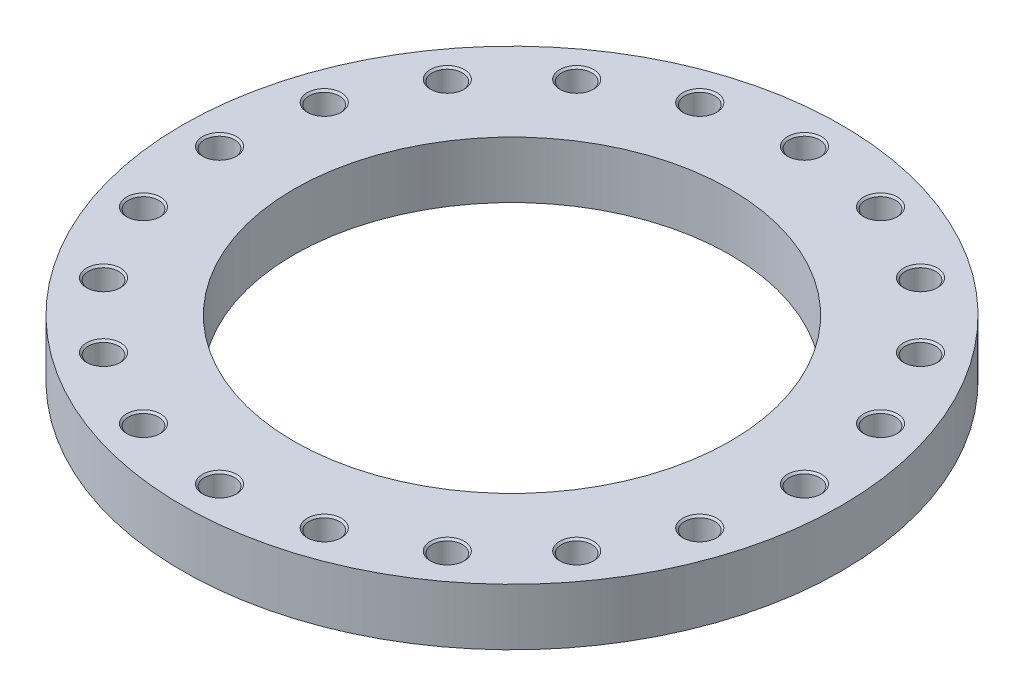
ISO-10303-21;
HEADER;
FILE_DESCRIPTION(('STEP AP214'),'2;1');
FILE_NAME('part.step','',(''),(''),'','','');
FILE_SCHEMA(('AUTOMOTIVE_DESIGN { 1 0 10303 214 1 1 1 1 }'));
ENDSEC;
DATA;
#1=APPLICATION_CONTEXT('core data for automotive mechanical design processes');
#2=APPLICATION_PROTOCOL_DEFINITION('international standard','automotive_design',2000,#1);
#3=PRODUCT_CONTEXT('',#1,'mechanical');
#4=PRODUCT('Part','Part','',(#3));
#5=PRODUCT_RELATED_PRODUCT_CATEGORY('part','',(#4));
#6=PRODUCT_DEFINITION_FORMATION('','',#4);
#7=PRODUCT_DEFINITION_CONTEXT('part definition',#1,'design');
#8=PRODUCT_DEFINITION('design','',#6,#7);
#9=PRODUCT_DEFINITION_SHAPE('','',#8);
#10=(LENGTH_UNIT() NAMED_UNIT(*) SI_UNIT(.MILLI.,.METRE.));
#11=(NAMED_UNIT(*) PLANE_ANGLE_UNIT() SI_UNIT($,.RADIAN.));
#12=(NAMED_UNIT(*) SI_UNIT($,.STERADIAN.) SOLID_ANGLE_UNIT());
#13=UNCERTAINTY_MEASURE_WITH_UNIT(LENGTH_MEASURE(1.E-05),#10,'distance_accuracy_value','');
#14=(GEOMETRIC_REPRESENTATION_CONTEXT(3) GLOBAL_UNCERTAINTY_ASSIGNED_CONTEXT((#13)) GLOBAL_UNIT_ASSIGNED_CONTEXT((#10,
#11,#12)) REPRESENTATION_CONTEXT('',''));
#15=CARTESIAN_POINT('',(0.,0.,0.));
#16=DIRECTION('',(0.,0.,1.));
#17=DIRECTION('',(1.,0.,0.));
#18=AXIS2_PLACEMENT_3D('',#15,#16,#17);
#19=CARTESIAN_POINT('',(0.,32.5,0.));
#20=DIRECTION('',(0.,-1.,0.));
#21=DIRECTION('',(1.,0.,0.));
#22=AXIS2_PLACEMENT_3D('',#19,#20,#21);
#23=CYLINDRICAL_SURFACE('',#22,377.5);
#24=CARTESIAN_POINT('',(0.,0.,0.));
#25=DIRECTION('',(0.,1.,0.));
#26=DIRECTION('',(1.,0.,0.));
#27=AXIS2_PLACEMENT_3D('',#24,#25,#26);
#28=CIRCLE('',#27,377.5);
#29=CARTESIAN_POINT('',(377.5,0.,0.));
#30=VERTEX_POINT('',#29);
#31=EDGE_CURVE('E9',#30,#30,#28,.T.);
#32=ORIENTED_EDGE('',*,*,#31,.T.);
#33=EDGE_LOOP('',(#32));
#34=FACE_BOUND('',#33,.T.);
#35=CARTESIAN_POINT('',(0.,65.,0.));
#36=DIRECTION('',(0.,1.,0.));
#37=DIRECTION('',(1.,0.,0.));
#38=AXIS2_PLACEMENT_3D('',#35,#36,#37);
#39=CIRCLE('',#38,377.5);
#40=CARTESIAN_POINT('',(377.5,65.,0.));
#41=VERTEX_POINT('',#40);
#42=EDGE_CURVE('E556',#41,#41,#39,.T.);
#43=ORIENTED_EDGE('',*,*,#42,.F.);
#44=EDGE_LOOP('',(#43));
#45=FACE_BOUND('',#44,.T.);
#46=ADVANCED_FACE('F15',(#34,#45),#23,.T.);
#47=CARTESIAN_POINT('',(313.75,0.,0.));
#48=DIRECTION('',(0.,-1.,0.));
#49=DIRECTION('',(-1.,0.,0.));
#50=AXIS2_PLACEMENT_3D('',#47,#48,#49);
#51=PLANE('',#50);
#52=CARTESIAN_POINT('',(0.,0.,0.));
#53=DIRECTION('',(0.,1.,0.));
#54=DIRECTION('',(1.,0.,0.));
#55=AXIS2_PLACEMENT_3D('',#52,#53,#54);
#56=CIRCLE('',#55,250.);
#57=CARTESIAN_POINT('',(250.,0.,0.));
#58=VERTEX_POINT('',#57);
#59=EDGE_CURVE('E24',#58,#58,#56,.T.);
#60=ORIENTED_EDGE('',*,*,#59,.T.);
#61=EDGE_LOOP('',(#60));
#62=FACE_BOUND('',#61,.T.);
#63=ORIENTED_EDGE('',*,*,#31,.F.);
#64=EDGE_LOOP('',(#63));
#65=FACE_BOUND('',#64,.T.);
#66=ADVANCED_FACE('F726',(#62,#65),#51,.T.);
#67=CARTESIAN_POINT('',(0.,32.5,0.));
#68=DIRECTION('',(0.,-1.,0.));
#69=DIRECTION('',(1.,0.,0.));
#70=AXIS2_PLACEMENT_3D('',#67,#68,#69);
#71=CYLINDRICAL_SURFACE('',#70,250.);
#72=CARTESIAN_POINT('',(0.,65.,0.));
#73=DIRECTION('',(0.,1.,0.));
#74=DIRECTION('',(1.,0.,0.));
#75=AXIS2_PLACEMENT_3D('',#72,#73,#74);
#76=CIRCLE('',#75,250.);
#77=CARTESIAN_POINT('',(250.,65.,0.));
#78=VERTEX_POINT('',#77);
#79=EDGE_CURVE('E477',#78,#78,#76,.T.);
#80=ORIENTED_EDGE('',*,*,#79,.T.);
#81=EDGE_LOOP('',(#80));
#82=FACE_BOUND('',#81,.T.);
#83=ORIENTED_EDGE('',*,*,#59,.F.);
#84=EDGE_LOOP('',(#83));
#85=FACE_BOUND('',#84,.T.);
#86=ADVANCED_FACE('F731',(#82,#85),#71,.F.);
#87=CARTESIAN_POINT('',(313.75,65.,0.));
#88=DIRECTION('',(0.,1.,0.));
#89=DIRECTION('',(1.,0.,0.));
#90=AXIS2_PLACEMENT_3D('',#87,#88,#89);
#91=PLANE('',#90);
#92=ORIENTED_EDGE('',*,*,#42,.T.);
#93=EDGE_LOOP('',(#92));
#94=FACE_BOUND('',#93,.T.);
#95=ORIENTED_EDGE('',*,*,#79,.F.);
#96=EDGE_LOOP('',(#95));
#97=FACE_BOUND('',#96,.T.);
#98=CARTESIAN_POINT('',(335.,65.,0.));
#99=DIRECTION('',(0.,-1.,0.));
#100=DIRECTION('',(1.,0.,0.));
#101=AXIS2_PLACEMENT_3D('',#98,#99,#100);
#102=CIRCLE('',#101,19.5);
#103=CARTESIAN_POINT('',(354.5,65.,0.));
#104=VERTEX_POINT('',#103);
#105=EDGE_CURVE('E600',#104,#104,#102,.T.);
#106=ORIENTED_EDGE('',*,*,#105,.T.);
#107=EDGE_LOOP('',(#106));
#108=FACE_BOUND('',#107,.T.);
#109=CARTESIAN_POINT('',(318.603932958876,65.,-103.520693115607));
#110=DIRECTION('',(0.,-1.,0.));
#111=DIRECTION('',(0.951056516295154,0.,-0.309016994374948));
#112=AXIS2_PLACEMENT_3D('',#109,#110,#111);
#113=CIRCLE('',#112,19.5);
#114=CARTESIAN_POINT('',(337.149535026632,65.,-109.546524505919));
#115=VERTEX_POINT('',#114);
#116=EDGE_CURVE('E574',#115,#115,#113,.T.);
#117=ORIENTED_EDGE('',*,*,#116,.T.);
#118=EDGE_LOOP('',(#117));
#119=FACE_BOUND('',#118,.T.);
#120=CARTESIAN_POINT('',(271.020693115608,65.,-196.908059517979));
#121=DIRECTION('',(0.,-1.,0.));
#122=DIRECTION('',(0.809016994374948,0.,-0.587785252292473));
#123=AXIS2_PLACEMENT_3D('',#120,#121,#122);
#124=CIRCLE('',#123,19.5);
#125=CARTESIAN_POINT('',(286.796524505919,65.,-208.369871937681));
#126=VERTEX_POINT('',#125);
#127=EDGE_CURVE('E548',#126,#126,#124,.T.);
#128=ORIENTED_EDGE('',*,*,#127,.T.);
#129=EDGE_LOOP('',(#128));
#130=FACE_BOUND('',#129,.T.);
#131=CARTESIAN_POINT('',(196.908059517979,65.,-271.020693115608));
#132=DIRECTION('',(0.,-1.,0.));
#133=DIRECTION('',(0.587785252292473,0.,-0.809016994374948));
#134=AXIS2_PLACEMENT_3D('',#131,#132,#133);
#135=CIRCLE('',#134,19.5);
#136=CARTESIAN_POINT('',(208.369871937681,65.,-286.796524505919));
#137=VERTEX_POINT('',#136);
#138=EDGE_CURVE('E586',#137,#137,#135,.T.);
#139=ORIENTED_EDGE('',*,*,#138,.T.);
#140=EDGE_LOOP('',(#139));
#141=FACE_BOUND('',#140,.T.);
#142=CARTESIAN_POINT('',(103.520693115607,65.,-318.603932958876));
#143=DIRECTION('',(0.,-1.,0.));
#144=DIRECTION('',(0.309016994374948,0.,-0.951056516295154));
#145=AXIS2_PLACEMENT_3D('',#142,#143,#144);
#146=CIRCLE('',#145,19.5);
#147=CARTESIAN_POINT('',(109.546524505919,65.,-337.149535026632));
#148=VERTEX_POINT('',#147);
#149=EDGE_CURVE('E668',#148,#148,#146,.T.);
#150=ORIENTED_EDGE('',*,*,#149,.T.);
#151=EDGE_LOOP('',(#150));
#152=FACE_BOUND('',#151,.T.);
#153=CARTESIAN_POINT('',(0.,65.,-335.));
#154=DIRECTION('',(0.,-1.,0.));
#155=DIRECTION('',(0.,0.,-1.));
#156=AXIS2_PLACEMENT_3D('',#153,#154,#155);
#157=CIRCLE('',#156,19.5);
#158=CARTESIAN_POINT('',(0.,65.,-354.5));
#159=VERTEX_POINT('',#158);
#160=EDGE_CURVE('E682',#159,#159,#157,.T.);
#161=ORIENTED_EDGE('',*,*,#160,.T.);
#162=EDGE_LOOP('',(#161));
#163=FACE_BOUND('',#162,.T.);
#164=CARTESIAN_POINT('',(-103.520693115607,65.,-318.603932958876));
#165=DIRECTION('',(0.,-1.,0.));
#166=DIRECTION('',(-0.309016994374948,0.,-0.951056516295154));
#167=AXIS2_PLACEMENT_3D('',#164,#165,#166);
#168=CIRCLE('',#167,19.5);
#169=CARTESIAN_POINT('',(-109.546524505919,65.,-337.149535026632));
#170=VERTEX_POINT('',#169);
#171=EDGE_CURVE('E627',#170,#170,#168,.T.);
#172=ORIENTED_EDGE('',*,*,#171,.T.);
#173=EDGE_LOOP('',(#172));
#174=FACE_BOUND('',#173,.T.);
#175=CARTESIAN_POINT('',(-196.908059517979,65.,-271.020693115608));
#176=DIRECTION('',(0.,-1.,0.));
#177=DIRECTION('',(-0.587785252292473,0.,-0.809016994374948));
#178=AXIS2_PLACEMENT_3D('',#175,#176,#177);
#179=CIRCLE('',#178,19.5);
#180=CARTESIAN_POINT('',(-208.369871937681,65.,-286.796524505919));
#181=VERTEX_POINT('',#180);
#182=EDGE_CURVE('E482',#181,#181,#179,.T.);
#183=ORIENTED_EDGE('',*,*,#182,.T.);
#184=EDGE_LOOP('',(#183));
#185=FACE_BOUND('',#184,.T.);
#186=CARTESIAN_POINT('',(-271.020693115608,65.,-196.908059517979));
#187=DIRECTION('',(0.,-1.,0.));
#188=DIRECTION('',(-0.809016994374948,0.,-0.587785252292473));
#189=AXIS2_PLACEMENT_3D('',#186,#187,#188);
#190=CIRCLE('',#189,19.5);
#191=CARTESIAN_POINT('',(-286.796524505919,65.,-208.369871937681));
#192=VERTEX_POINT('',#191);
#193=EDGE_CURVE('E660',#192,#192,#190,.T.);
#194=ORIENTED_EDGE('',*,*,#193,.T.);
#195=EDGE_LOOP('',(#194));
#196=FACE_BOUND('',#195,.T.);
#197=CARTESIAN_POINT('',(-318.603932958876,65.,-103.520693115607));
#198=DIRECTION('',(0.,-1.,0.));
#199=DIRECTION('',(-0.951056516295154,0.,-0.309016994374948));
#200=AXIS2_PLACEMENT_3D('',#197,#198,#199);
#201=CIRCLE('',#200,19.5);
#202=CARTESIAN_POINT('',(-337.149535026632,65.,-109.546524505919));
#203=VERTEX_POINT('',#202);
#204=EDGE_CURVE('E549',#203,#203,#201,.T.);
#205=ORIENTED_EDGE('',*,*,#204,.T.);
#206=EDGE_LOOP('',(#205));
#207=FACE_BOUND('',#206,.T.);
#208=CARTESIAN_POINT('',(-335.,65.,0.));
#209=DIRECTION('',(0.,-1.,0.));
#210=DIRECTION('',(-1.,0.,0.));
#211=AXIS2_PLACEMENT_3D('',#208,#209,#210);
#212=CIRCLE('',#211,19.5);
#213=CARTESIAN_POINT('',(-354.5,65.,0.));
#214=VERTEX_POINT('',#213);
#215=EDGE_CURVE('E616',#214,#214,#212,.T.);
#216=ORIENTED_EDGE('',*,*,#215,.T.);
#217=EDGE_LOOP('',(#216));
#218=FACE_BOUND('',#217,.T.);
#219=CARTESIAN_POINT('',(-318.603932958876,65.,103.520693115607));
#220=DIRECTION('',(0.,-1.,0.));
#221=DIRECTION('',(-0.951056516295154,0.,0.309016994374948));
#222=AXIS2_PLACEMENT_3D('',#219,#220,#221);
#223=CIRCLE('',#222,19.5);
#224=CARTESIAN_POINT('',(-337.149535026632,65.,109.546524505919));
#225=VERTEX_POINT('',#224);
#226=EDGE_CURVE('E636',#225,#225,#223,.T.);
#227=ORIENTED_EDGE('',*,*,#226,.T.);
#228=EDGE_LOOP('',(#227));
#229=FACE_BOUND('',#228,.T.);
#230=CARTESIAN_POINT('',(-271.020693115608,65.,196.908059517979));
#231=DIRECTION('',(0.,-1.,0.));
#232=DIRECTION('',(-0.809016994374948,0.,0.587785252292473));
#233=AXIS2_PLACEMENT_3D('',#230,#231,#232);
#234=CIRCLE('',#233,19.5);
#235=CARTESIAN_POINT('',(-286.796524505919,65.,208.369871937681));
#236=VERTEX_POINT('',#235);
#237=EDGE_CURVE('E620',#236,#236,#234,.T.);
#238=ORIENTED_EDGE('',*,*,#237,.T.);
#239=EDGE_LOOP('',(#238));
#240=FACE_BOUND('',#239,.T.);
#241=CARTESIAN_POINT('',(-196.908059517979,65.,271.020693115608));
#242=DIRECTION('',(0.,-1.,0.));
#243=DIRECTION('',(-0.587785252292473,0.,0.809016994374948));
#244=AXIS2_PLACEMENT_3D('',#241,#242,#243);
#245=CIRCLE('',#244,19.5);
#246=CARTESIAN_POINT('',(-208.369871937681,65.,286.796524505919));
#247=VERTEX_POINT('',#246);
#248=EDGE_CURVE('E609',#247,#247,#245,.T.);
#249=ORIENTED_EDGE('',*,*,#248,.T.);
#250=EDGE_LOOP('',(#249));
#251=FACE_BOUND('',#250,.T.);
#252=CARTESIAN_POINT('',(-103.520693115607,65.,318.603932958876));
#253=DIRECTION('',(0.,-1.,0.));
#254=DIRECTION('',(-0.309016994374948,0.,0.951056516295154));
#255=AXIS2_PLACEMENT_3D('',#252,#253,#254);
#256=CIRCLE('',#255,19.5);
#257=CARTESIAN_POINT('',(-109.546524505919,65.,337.149535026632));
#258=VERTEX_POINT('',#257);
#259=EDGE_CURVE('E580',#258,#258,#256,.T.);
#260=ORIENTED_EDGE('',*,*,#259,.T.);
#261=EDGE_LOOP('',(#260));
#262=FACE_BOUND('',#261,.T.);
#263=CARTESIAN_POINT('',(0.,65.,335.));
#264=DIRECTION('',(0.,-1.,0.));
#265=DIRECTION('',(0.,0.,1.));
#266=AXIS2_PLACEMENT_3D('',#263,#264,#265);
#267=CIRCLE('',#266,19.5);
#268=CARTESIAN_POINT('',(0.,65.,354.5));
#269=VERTEX_POINT('',#268);
#270=EDGE_CURVE('E554',#269,#269,#267,.T.);
#271=ORIENTED_EDGE('',*,*,#270,.T.);
#272=EDGE_LOOP('',(#271));
#273=FACE_BOUND('',#272,.T.);
#274=CARTESIAN_POINT('',(103.520693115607,65.,318.603932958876));
#275=DIRECTION('',(0.,-1.,0.));
#276=DIRECTION('',(0.309016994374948,0.,0.951056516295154));
#277=AXIS2_PLACEMENT_3D('',#274,#275,#276);
#278=CIRCLE('',#277,19.5);
#279=CARTESIAN_POINT('',(109.546524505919,65.,337.149535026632));
#280=VERTEX_POINT('',#279);
#281=EDGE_CURVE('E532',#280,#280,#278,.T.);
#282=ORIENTED_EDGE('',*,*,#281,.T.);
#283=EDGE_LOOP('',(#282));
#284=FACE_BOUND('',#283,.T.);
#285=CARTESIAN_POINT('',(196.908059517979,65.,271.020693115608));
#286=DIRECTION('',(0.,-1.,0.));
#287=DIRECTION('',(0.587785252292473,0.,0.809016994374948));
#288=AXIS2_PLACEMENT_3D('',#285,#286,#287);
#289=CIRCLE('',#288,19.5);
#290=CARTESIAN_POINT('',(208.369871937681,65.,286.796524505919));
#291=VERTEX_POINT('',#290);
#292=EDGE_CURVE('E504',#291,#291,#289,.T.);
#293=ORIENTED_EDGE('',*,*,#292,.T.);
#294=EDGE_LOOP('',(#293));
#295=FACE_BOUND('',#294,.T.);
#296=CARTESIAN_POINT('',(271.020693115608,65.,196.908059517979));
#297=DIRECTION('',(0.,-1.,0.));
#298=DIRECTION('',(0.809016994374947,0.,0.587785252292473));
#299=AXIS2_PLACEMENT_3D('',#296,#297,#298);
#300=CIRCLE('',#299,19.5);
#301=CARTESIAN_POINT('',(286.796524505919,65.,208.369871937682));
#302=VERTEX_POINT('',#301);
#303=EDGE_CURVE('E471',#302,#302,#300,.T.);
#304=ORIENTED_EDGE('',*,*,#303,.T.);
#305=EDGE_LOOP('',(#304));
#306=FACE_BOUND('',#305,.T.);
#307=CARTESIAN_POINT('',(318.603932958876,65.,103.520693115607));
#308=DIRECTION('',(0.,-1.,0.));
#309=DIRECTION('',(0.951056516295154,0.,0.309016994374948));
#310=AXIS2_PLACEMENT_3D('',#307,#308,#309);
#311=CIRCLE('',#310,19.5);
#312=CARTESIAN_POINT('',(337.149535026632,65.,109.546524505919));
#313=VERTEX_POINT('',#312);
#314=EDGE_CURVE('E463',#313,#313,#311,.T.);
#315=ORIENTED_EDGE('',*,*,#314,.T.);
#316=EDGE_LOOP('',(#315));
#317=FACE_BOUND('',#316,.T.);
#318=ADVANCED_FACE('F852',(#94,#97,#108,#119,#130,#141,#152,#163,#174,#185,#196,#207,#218,#229,
#240,#251,#262,#273,#284,#295,#306,#317),#91,.T.);
#319=CARTESIAN_POINT('',(335.,9.99581654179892,0.));
#320=DIRECTION('',(0.,1.,0.));
#321=DIRECTION('',(1.,0.,0.));
#322=AXIS2_PLACEMENT_3D('',#319,#320,#321);
#323=CONICAL_SURFACE('',#322,8.6675,1.0471975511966);
#324=CARTESIAN_POINT('',(335.,15.,0.));
#325=DIRECTION('',(0.,-1.,0.));
#326=DIRECTION('',(1.,0.,0.));
#327=AXIS2_PLACEMENT_3D('',#324,#325,#326);
#328=CIRCLE('',#327,17.335);
#329=CARTESIAN_POINT('',(352.335,15.,0.));
#330=VERTEX_POINT('',#329);
#331=EDGE_CURVE('E475',#330,#330,#328,.T.);
#332=ORIENTED_EDGE('',*,*,#331,.F.);
#333=EDGE_LOOP('',(#332));
#334=FACE_BOUND('',#333,.T.);
#335=CARTESIAN_POINT('',(335.,4.99163308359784,0.));
#336=VERTEX_POINT('',#335);
#337=VERTEX_LOOP('',#336);
#338=FACE_BOUND('',#337,.T.);
#339=ADVANCED_FACE('F17',(#334,#338),#323,.F.);
#340=CARTESIAN_POINT('',(335.,19.9175,0.));
#341=DIRECTION('',(0.,1.,0.));
#342=DIRECTION('',(1.,0.,0.));
#343=AXIS2_PLACEMENT_3D('',#340,#341,#342);
#344=CYLINDRICAL_SURFACE('',#343,17.335);
#345=CARTESIAN_POINT('',(335.,24.835,0.));
#346=DIRECTION('',(0.,-1.,0.));
#347=DIRECTION('',(1.,0.,0.));
#348=AXIS2_PLACEMENT_3D('',#345,#346,#347);
#349=CIRCLE('',#348,17.335);
#350=CARTESIAN_POINT('',(352.335,24.835,0.));
#351=VERTEX_POINT('',#350);
#352=EDGE_CURVE('E19',#351,#351,#349,.T.);
#353=ORIENTED_EDGE('',*,*,#352,.F.);
#354=EDGE_LOOP('',(#353));
#355=FACE_BOUND('',#354,.T.);
#356=ORIENTED_EDGE('',*,*,#331,.T.);
#357=EDGE_LOOP('',(#356));
#358=FACE_BOUND('',#357,.T.);
#359=ADVANCED_FACE('F1099',(#355,#358),#344,.F.);
#360=CARTESIAN_POINT('',(335.,25.9175,0.));
#361=DIRECTION('',(0.,1.,0.));
#362=DIRECTION('',(1.,0.,0.));
#363=AXIS2_PLACEMENT_3D('',#360,#361,#362);
#364=CONICAL_SURFACE('',#363,18.4175,0.785398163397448);
#365=CARTESIAN_POINT('',(335.,27.,0.));
#366=DIRECTION('',(0.,-1.,0.));
#367=DIRECTION('',(1.,0.,0.));
#368=AXIS2_PLACEMENT_3D('',#365,#366,#367);
#369=CIRCLE('',#368,19.5);
#370=CARTESIAN_POINT('',(354.5,27.,0.));
#371=VERTEX_POINT('',#370);
#372=EDGE_CURVE('E515',#371,#371,#369,.T.);
#373=ORIENTED_EDGE('',*,*,#372,.F.);
#374=EDGE_LOOP('',(#373));
#375=FACE_BOUND('',#374,.T.);
#376=ORIENTED_EDGE('',*,*,#352,.T.);
#377=EDGE_LOOP('',(#376));
#378=FACE_BOUND('',#377,.T.);
#379=ADVANCED_FACE('F1102',(#375,#378),#364,.F.);
#380=CARTESIAN_POINT('',(353.4175,27.,0.));
#381=DIRECTION('',(0.,1.,0.));
#382=DIRECTION('',(-1.,0.,0.));
#383=AXIS2_PLACEMENT_3D('',#380,#381,#382);
#384=PLANE('',#383);
#385=CARTESIAN_POINT('',(335.,27.,0.));
#386=DIRECTION('',(0.,-1.,0.));
#387=DIRECTION('',(1.,0.,0.));
#388=AXIS2_PLACEMENT_3D('',#385,#386,#387);
#389=CIRCLE('',#388,17.335);
#390=CARTESIAN_POINT('',(352.335,27.,0.));
#391=VERTEX_POINT('',#390);
#392=EDGE_CURVE('E469',#391,#391,#389,.T.);
#393=ORIENTED_EDGE('',*,*,#392,.F.);
#394=EDGE_LOOP('',(#393));
#395=FACE_BOUND('',#394,.T.);
#396=ORIENTED_EDGE('',*,*,#372,.T.);
#397=EDGE_LOOP('',(#396));
#398=FACE_BOUND('',#397,.T.);
#399=ADVANCED_FACE('F919',(#395,#398),#384,.F.);
#400=CARTESIAN_POINT('',(335.,44.9175,0.));
#401=DIRECTION('',(0.,1.,0.));
#402=DIRECTION('',(1.,0.,0.));
#403=AXIS2_PLACEMENT_3D('',#400,#401,#402);
#404=CYLINDRICAL_SURFACE('',#403,17.335);
#405=CARTESIAN_POINT('',(335.,62.835,0.));
#406=DIRECTION('',(0.,-1.,0.));
#407=DIRECTION('',(1.,0.,0.));
#408=AXIS2_PLACEMENT_3D('',#405,#406,#407);
#409=CIRCLE('',#408,17.335);
#410=CARTESIAN_POINT('',(352.335,62.835,0.));
#411=VERTEX_POINT('',#410);
#412=EDGE_CURVE('E598',#411,#411,#409,.T.);
#413=ORIENTED_EDGE('',*,*,#412,.F.);
#414=EDGE_LOOP('',(#413));
#415=FACE_BOUND('',#414,.T.);
#416=ORIENTED_EDGE('',*,*,#392,.T.);
#417=EDGE_LOOP('',(#416));
#418=FACE_BOUND('',#417,.T.);
#419=ADVANCED_FACE('F915',(#415,#418),#404,.F.);
#420=CARTESIAN_POINT('',(335.,63.9175,0.));
#421=DIRECTION('',(0.,1.,0.));
#422=DIRECTION('',(1.,0.,0.));
#423=AXIS2_PLACEMENT_3D('',#420,#421,#422);
#424=CONICAL_SURFACE('',#423,18.4175,0.785398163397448);
#425=ORIENTED_EDGE('',*,*,#105,.F.);
#426=EDGE_LOOP('',(#425));
#427=FACE_BOUND('',#426,.T.);
#428=ORIENTED_EDGE('',*,*,#412,.T.);
#429=EDGE_LOOP('',(#428));
#430=FACE_BOUND('',#429,.T.);
#431=ADVANCED_FACE('F918',(#427,#430),#424,.F.);
#432=CARTESIAN_POINT('',(318.603932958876,9.99581654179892,-103.520693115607));
#433=DIRECTION('',(0.,1.,0.));
#434=DIRECTION('',(0.951056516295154,0.,-0.309016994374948));
#435=AXIS2_PLACEMENT_3D('',#432,#433,#434);
#436=CONICAL_SURFACE('',#435,8.6675,1.0471975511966);
#437=CARTESIAN_POINT('',(318.603932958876,15.,-103.520693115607));
#438=DIRECTION('',(0.,-1.,0.));
#439=DIRECTION('',(0.951056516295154,0.,-0.309016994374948));
#440=AXIS2_PLACEMENT_3D('',#437,#438,#439);
#441=CIRCLE('',#440,17.335);
#442=CARTESIAN_POINT('',(335.090497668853,15.,-108.877502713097));
#443=VERTEX_POINT('',#442);
#444=EDGE_CURVE('E595',#443,#443,#441,.T.);
#445=ORIENTED_EDGE('',*,*,#444,.F.);
#446=EDGE_LOOP('',(#445));
#447=FACE_BOUND('',#446,.T.);
#448=CARTESIAN_POINT('',(318.603932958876,4.99163308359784,-103.520693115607));
#449=VERTEX_POINT('',#448);
#450=VERTEX_LOOP('',#449);
#451=FACE_BOUND('',#450,.T.);
#452=ADVANCED_FACE('F1094',(#447,#451),#436,.F.);
#453=CARTESIAN_POINT('',(318.603932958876,19.9175,-103.520693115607));
#454=DIRECTION('',(0.,1.,0.));
#455=DIRECTION('',(0.951056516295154,0.,-0.309016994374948));
#456=AXIS2_PLACEMENT_3D('',#453,#454,#455);
#457=CYLINDRICAL_SURFACE('',#456,17.335);
#458=CARTESIAN_POINT('',(318.603932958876,24.835,-103.520693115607));
#459=DIRECTION('',(0.,-1.,0.));
#460=DIRECTION('',(0.951056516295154,0.,-0.309016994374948));
#461=AXIS2_PLACEMENT_3D('',#458,#459,#460);
#462=CIRCLE('',#461,17.335);
#463=CARTESIAN_POINT('',(335.090497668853,24.835,-108.877502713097));
#464=VERTEX_POINT('',#463);
#465=EDGE_CURVE('E541',#464,#464,#462,.T.);
#466=ORIENTED_EDGE('',*,*,#465,.F.);
#467=EDGE_LOOP('',(#466));
#468=FACE_BOUND('',#467,.T.);
#469=ORIENTED_EDGE('',*,*,#444,.T.);
#470=EDGE_LOOP('',(#469));
#471=FACE_BOUND('',#470,.T.);
#472=ADVANCED_FACE('F1121',(#468,#471),#457,.F.);
#473=CARTESIAN_POINT('',(318.603932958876,25.9175,-103.520693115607));
#474=DIRECTION('',(0.,1.,0.));
#475=DIRECTION('',(0.951056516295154,0.,-0.309016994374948));
#476=AXIS2_PLACEMENT_3D('',#473,#474,#475);
#477=CONICAL_SURFACE('',#476,18.4175,0.785398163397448);
#478=CARTESIAN_POINT('',(318.603932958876,27.,-103.520693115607));
#479=DIRECTION('',(0.,-1.,0.));
#480=DIRECTION('',(0.951056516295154,0.,-0.309016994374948));
#481=AXIS2_PLACEMENT_3D('',#478,#479,#480);
#482=CIRCLE('',#481,19.5);
#483=CARTESIAN_POINT('',(337.149535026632,27.,-109.546524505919));
#484=VERTEX_POINT('',#483);
#485=EDGE_CURVE('E539',#484,#484,#482,.T.);
#486=ORIENTED_EDGE('',*,*,#485,.F.);
#487=EDGE_LOOP('',(#486));
#488=FACE_BOUND('',#487,.T.);
#489=ORIENTED_EDGE('',*,*,#465,.T.);
#490=EDGE_LOOP('',(#489));
#491=FACE_BOUND('',#490,.T.);
#492=ADVANCED_FACE('F1119',(#488,#491),#477,.F.);
#493=CARTESIAN_POINT('',(336.120016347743,27.,-109.212013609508));
#494=DIRECTION('',(0.,1.,0.));
#495=DIRECTION('',(-0.951056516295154,0.,0.309016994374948));
#496=AXIS2_PLACEMENT_3D('',#493,#494,#495);
#497=PLANE('',#496);
#498=CARTESIAN_POINT('',(318.603932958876,27.,-103.520693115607));
#499=DIRECTION('',(0.,-1.,0.));
#500=DIRECTION('',(0.951056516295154,0.,-0.309016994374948));
#501=AXIS2_PLACEMENT_3D('',#498,#499,#500);
#502=CIRCLE('',#501,17.335);
#503=CARTESIAN_POINT('',(335.090497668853,27.,-108.877502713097));
#504=VERTEX_POINT('',#503);
#505=EDGE_CURVE('E542',#504,#504,#502,.T.);
#506=ORIENTED_EDGE('',*,*,#505,.F.);
#507=EDGE_LOOP('',(#506));
#508=FACE_BOUND('',#507,.T.);
#509=ORIENTED_EDGE('',*,*,#485,.T.);
#510=EDGE_LOOP('',(#509));
#511=FACE_BOUND('',#510,.T.);
#512=ADVANCED_FACE('F1115',(#508,#511),#497,.F.);
#513=CARTESIAN_POINT('',(318.603932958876,44.9175,-103.520693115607));
#514=DIRECTION('',(0.,1.,0.));
#515=DIRECTION('',(0.951056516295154,0.,-0.309016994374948));
#516=AXIS2_PLACEMENT_3D('',#513,#514,#515);
#517=CYLINDRICAL_SURFACE('',#516,17.335);
#518=CARTESIAN_POINT('',(318.603932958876,62.835,-103.520693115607));
#519=DIRECTION('',(0.,-1.,0.));
#520=DIRECTION('',(0.951056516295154,0.,-0.309016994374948));
#521=AXIS2_PLACEMENT_3D('',#518,#519,#520);
#522=CIRCLE('',#521,17.335);
#523=CARTESIAN_POINT('',(335.090497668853,62.835,-108.877502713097));
#524=VERTEX_POINT('',#523);
#525=EDGE_CURVE('E572',#524,#524,#522,.T.);
#526=ORIENTED_EDGE('',*,*,#525,.F.);
#527=EDGE_LOOP('',(#526));
#528=FACE_BOUND('',#527,.T.);
#529=ORIENTED_EDGE('',*,*,#505,.T.);
#530=EDGE_LOOP('',(#529));
#531=FACE_BOUND('',#530,.T.);
#532=ADVANCED_FACE('F720',(#528,#531),#517,.F.);
#533=CARTESIAN_POINT('',(318.603932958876,63.9175,-103.520693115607));
#534=DIRECTION('',(0.,1.,0.));
#535=DIRECTION('',(0.951056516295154,0.,-0.309016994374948));
#536=AXIS2_PLACEMENT_3D('',#533,#534,#535);
#537=CONICAL_SURFACE('',#536,18.4175,0.785398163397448);
#538=ORIENTED_EDGE('',*,*,#116,.F.);
#539=EDGE_LOOP('',(#538));
#540=FACE_BOUND('',#539,.T.);
#541=ORIENTED_EDGE('',*,*,#525,.T.);
#542=EDGE_LOOP('',(#541));
#543=FACE_BOUND('',#542,.T.);
#544=ADVANCED_FACE('F710',(#540,#543),#537,.F.);
#545=CARTESIAN_POINT('',(271.020693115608,9.99581654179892,-196.908059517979));
#546=DIRECTION('',(0.,1.,0.));
#547=DIRECTION('',(0.809016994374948,0.,-0.587785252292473));
#548=AXIS2_PLACEMENT_3D('',#545,#546,#547);
#549=CONICAL_SURFACE('',#548,8.6675,1.0471975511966);
#550=CARTESIAN_POINT('',(271.020693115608,15.,-196.908059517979));
#551=DIRECTION('',(0.,-1.,0.));
#552=DIRECTION('',(0.809016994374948,0.,-0.587785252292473));
#553=AXIS2_PLACEMENT_3D('',#550,#551,#552);
#554=CIRCLE('',#553,17.335);
#555=CARTESIAN_POINT('',(285.045002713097,15.,-207.097316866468));
#556=VERTEX_POINT('',#555);
#557=EDGE_CURVE('E575',#556,#556,#554,.T.);
#558=ORIENTED_EDGE('',*,*,#557,.F.);
#559=EDGE_LOOP('',(#558));
#560=FACE_BOUND('',#559,.T.);
#561=CARTESIAN_POINT('',(271.020693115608,4.99163308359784,-196.908059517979));
#562=VERTEX_POINT('',#561);
#563=VERTEX_LOOP('',#562);
#564=FACE_BOUND('',#563,.T.);
#565=ADVANCED_FACE('F707',(#560,#564),#549,.F.);
#566=CARTESIAN_POINT('',(271.020693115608,19.9175,-196.908059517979));
#567=DIRECTION('',(0.,1.,0.));
#568=DIRECTION('',(0.809016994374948,0.,-0.587785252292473));
#569=AXIS2_PLACEMENT_3D('',#566,#567,#568);
#570=CYLINDRICAL_SURFACE('',#569,17.335);
#571=CARTESIAN_POINT('',(271.020693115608,24.835,-196.908059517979));
#572=DIRECTION('',(0.,-1.,0.));
#573=DIRECTION('',(0.809016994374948,0.,-0.587785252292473));
#574=AXIS2_PLACEMENT_3D('',#571,#572,#573);
#575=CIRCLE('',#574,17.335);
#576=CARTESIAN_POINT('',(285.045002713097,24.835,-207.097316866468));
#577=VERTEX_POINT('',#576);
#578=EDGE_CURVE('E510',#577,#577,#575,.T.);
#579=ORIENTED_EDGE('',*,*,#578,.F.);
#580=EDGE_LOOP('',(#579));
#581=FACE_BOUND('',#580,.T.);
#582=ORIENTED_EDGE('',*,*,#557,.T.);
#583=EDGE_LOOP('',(#582));
#584=FACE_BOUND('',#583,.T.);
#585=ADVANCED_FACE('F705',(#581,#584),#570,.F.);
#586=CARTESIAN_POINT('',(271.020693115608,25.9175,-196.908059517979));
#587=DIRECTION('',(0.,1.,0.));
#588=DIRECTION('',(0.809016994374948,0.,-0.587785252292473));
#589=AXIS2_PLACEMENT_3D('',#586,#587,#588);
#590=CONICAL_SURFACE('',#589,18.4175,0.785398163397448);
#591=CARTESIAN_POINT('',(271.020693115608,27.,-196.908059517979));
#592=DIRECTION('',(0.,-1.,0.));
#593=DIRECTION('',(0.809016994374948,0.,-0.587785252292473));
#594=AXIS2_PLACEMENT_3D('',#591,#592,#593);
#595=CIRCLE('',#594,19.5);
#596=CARTESIAN_POINT('',(286.796524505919,27.,-208.369871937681));
#597=VERTEX_POINT('',#596);
#598=EDGE_CURVE('E508',#597,#597,#595,.T.);
#599=ORIENTED_EDGE('',*,*,#598,.F.);
#600=EDGE_LOOP('',(#599));
#601=FACE_BOUND('',#600,.T.);
#602=ORIENTED_EDGE('',*,*,#578,.T.);
#603=EDGE_LOOP('',(#602));
#604=FACE_BOUND('',#603,.T.);
#605=ADVANCED_FACE('F717',(#601,#604),#590,.F.);
#606=CARTESIAN_POINT('',(285.920763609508,27.,-207.733594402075));
#607=DIRECTION('',(0.,1.,0.));
#608=DIRECTION('',(-0.809016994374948,0.,0.587785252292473));
#609=AXIS2_PLACEMENT_3D('',#606,#607,#608);
#610=PLANE('',#609);
#611=CARTESIAN_POINT('',(271.020693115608,27.,-196.908059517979));
#612=DIRECTION('',(0.,-1.,0.));
#613=DIRECTION('',(0.809016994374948,0.,-0.587785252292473));
#614=AXIS2_PLACEMENT_3D('',#611,#612,#613);
#615=CIRCLE('',#614,17.335);
#616=CARTESIAN_POINT('',(285.045002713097,27.,-207.097316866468));
#617=VERTEX_POINT('',#616);
#618=EDGE_CURVE('E511',#617,#617,#615,.T.);
#619=ORIENTED_EDGE('',*,*,#618,.F.);
#620=EDGE_LOOP('',(#619));
#621=FACE_BOUND('',#620,.T.);
#622=ORIENTED_EDGE('',*,*,#598,.T.);
#623=EDGE_LOOP('',(#622));
#624=FACE_BOUND('',#623,.T.);
#625=ADVANCED_FACE('F924',(#621,#624),#610,.F.);
#626=CARTESIAN_POINT('',(271.020693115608,44.9175,-196.908059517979));
#627=DIRECTION('',(0.,1.,0.));
#628=DIRECTION('',(0.809016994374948,0.,-0.587785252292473));
#629=AXIS2_PLACEMENT_3D('',#626,#627,#628);
#630=CYLINDRICAL_SURFACE('',#629,17.335);
#631=CARTESIAN_POINT('',(271.020693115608,62.835,-196.908059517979));
#632=DIRECTION('',(0.,-1.,0.));
#633=DIRECTION('',(0.809016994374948,0.,-0.587785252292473));
#634=AXIS2_PLACEMENT_3D('',#631,#632,#633);
#635=CIRCLE('',#634,17.335);
#636=CARTESIAN_POINT('',(285.045002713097,62.835,-207.097316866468));
#637=VERTEX_POINT('',#636);
#638=EDGE_CURVE('E607',#637,#637,#635,.T.);
#639=ORIENTED_EDGE('',*,*,#638,.F.);
#640=EDGE_LOOP('',(#639));
#641=FACE_BOUND('',#640,.T.);
#642=ORIENTED_EDGE('',*,*,#618,.T.);
#643=EDGE_LOOP('',(#642));
#644=FACE_BOUND('',#643,.T.);
#645=ADVANCED_FACE('F927',(#641,#644),#630,.F.);
#646=CARTESIAN_POINT('',(271.020693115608,63.9175,-196.908059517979));
#647=DIRECTION('',(0.,1.,0.));
#648=DIRECTION('',(0.809016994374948,0.,-0.587785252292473));
#649=AXIS2_PLACEMENT_3D('',#646,#647,#648);
#650=CONICAL_SURFACE('',#649,18.4175,0.785398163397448);
#651=ORIENTED_EDGE('',*,*,#127,.F.);
#652=EDGE_LOOP('',(#651));
#653=FACE_BOUND('',#652,.T.);
#654=ORIENTED_EDGE('',*,*,#638,.T.);
#655=EDGE_LOOP('',(#654));
#656=FACE_BOUND('',#655,.T.);
#657=ADVANCED_FACE('F788',(#653,#656),#650,.F.);
#658=CARTESIAN_POINT('',(196.908059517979,9.99581654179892,-271.020693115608));
#659=DIRECTION('',(0.,1.,0.));
#660=DIRECTION('',(0.587785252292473,0.,-0.809016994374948));
#661=AXIS2_PLACEMENT_3D('',#658,#659,#660);
#662=CONICAL_SURFACE('',#661,8.6675,1.0471975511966);
#663=CARTESIAN_POINT('',(196.908059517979,15.,-271.020693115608));
#664=DIRECTION('',(0.,-1.,0.));
#665=DIRECTION('',(0.587785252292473,0.,-0.809016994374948));
#666=AXIS2_PLACEMENT_3D('',#663,#664,#665);
#667=CIRCLE('',#666,17.335);
#668=CARTESIAN_POINT('',(207.097316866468,15.,-285.045002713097));
#669=VERTEX_POINT('',#668);
#670=EDGE_CURVE('E605',#669,#669,#667,.T.);
#671=ORIENTED_EDGE('',*,*,#670,.F.);
#672=EDGE_LOOP('',(#671));
#673=FACE_BOUND('',#672,.T.);
#674=CARTESIAN_POINT('',(196.908059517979,4.99163308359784,-271.020693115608));
#675=VERTEX_POINT('',#674);
#676=VERTEX_LOOP('',#675);
#677=FACE_BOUND('',#676,.T.);
#678=ADVANCED_FACE('F784',(#673,#677),#662,.F.);
#679=CARTESIAN_POINT('',(196.908059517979,19.9175,-271.020693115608));
#680=DIRECTION('',(0.,1.,0.));
#681=DIRECTION('',(0.587785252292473,0.,-0.809016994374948));
#682=AXIS2_PLACEMENT_3D('',#679,#680,#681);
#683=CYLINDRICAL_SURFACE('',#682,17.335);
#684=CARTESIAN_POINT('',(196.908059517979,24.835,-271.020693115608));
#685=DIRECTION('',(0.,-1.,0.));
#686=DIRECTION('',(0.587785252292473,0.,-0.809016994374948));
#687=AXIS2_PLACEMENT_3D('',#684,#685,#686);
#688=CIRCLE('',#687,17.335);
#689=CARTESIAN_POINT('',(207.097316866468,24.835,-285.045002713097));
#690=VERTEX_POINT('',#689);
#691=EDGE_CURVE('E479',#690,#690,#688,.T.);
#692=ORIENTED_EDGE('',*,*,#691,.F.);
#693=EDGE_LOOP('',(#692));
#694=FACE_BOUND('',#693,.T.);
#695=ORIENTED_EDGE('',*,*,#670,.T.);
#696=EDGE_LOOP('',(#695));
#697=FACE_BOUND('',#696,.T.);
#698=ADVANCED_FACE('F787',(#694,#697),#683,.F.);
#699=CARTESIAN_POINT('',(196.908059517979,25.9175,-271.020693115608));
#700=DIRECTION('',(0.,1.,0.));
#701=DIRECTION('',(0.587785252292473,0.,-0.809016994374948));
#702=AXIS2_PLACEMENT_3D('',#699,#700,#701);
#703=CONICAL_SURFACE('',#702,18.4175,0.785398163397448);
#704=CARTESIAN_POINT('',(196.908059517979,27.,-271.020693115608));
#705=DIRECTION('',(0.,-1.,0.));
#706=DIRECTION('',(0.587785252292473,0.,-0.809016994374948));
#707=AXIS2_PLACEMENT_3D('',#704,#705,#706);
#708=CIRCLE('',#707,19.5);
#709=CARTESIAN_POINT('',(208.369871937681,27.,-286.796524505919));
#710=VERTEX_POINT('',#709);
#711=EDGE_CURVE('E478',#710,#710,#708,.T.);
#712=ORIENTED_EDGE('',*,*,#711,.F.);
#713=EDGE_LOOP('',(#712));
#714=FACE_BOUND('',#713,.T.);
#715=ORIENTED_EDGE('',*,*,#691,.T.);
#716=EDGE_LOOP('',(#715));
#717=FACE_BOUND('',#716,.T.);
#718=ADVANCED_FACE('F802',(#714,#717),#703,.F.);
#719=CARTESIAN_POINT('',(207.733594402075,27.,-285.920763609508));
#720=DIRECTION('',(0.,1.,0.));
#721=DIRECTION('',(-0.587785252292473,0.,0.809016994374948));
#722=AXIS2_PLACEMENT_3D('',#719,#720,#721);
#723=PLANE('',#722);
#724=CARTESIAN_POINT('',(196.908059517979,27.,-271.020693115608));
#725=DIRECTION('',(0.,-1.,0.));
#726=DIRECTION('',(0.587785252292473,0.,-0.809016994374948));
#727=AXIS2_PLACEMENT_3D('',#724,#725,#726);
#728=CIRCLE('',#727,17.335);
#729=CARTESIAN_POINT('',(207.097316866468,27.,-285.045002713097));
#730=VERTEX_POINT('',#729);
#731=EDGE_CURVE('E480',#730,#730,#728,.T.);
#732=ORIENTED_EDGE('',*,*,#731,.F.);
#733=EDGE_LOOP('',(#732));
#734=FACE_BOUND('',#733,.T.);
#735=ORIENTED_EDGE('',*,*,#711,.T.);
#736=EDGE_LOOP('',(#735));
#737=FACE_BOUND('',#736,.T.);
#738=ADVANCED_FACE('F754',(#734,#737),#723,.F.);
#739=CARTESIAN_POINT('',(196.908059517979,44.9175,-271.020693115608));
#740=DIRECTION('',(0.,1.,0.));
#741=DIRECTION('',(0.587785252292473,0.,-0.809016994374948));
#742=AXIS2_PLACEMENT_3D('',#739,#740,#741);
#743=CYLINDRICAL_SURFACE('',#742,17.335);
#744=CARTESIAN_POINT('',(196.908059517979,62.835,-271.020693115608));
#745=DIRECTION('',(0.,-1.,0.));
#746=DIRECTION('',(0.587785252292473,0.,-0.809016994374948));
#747=AXIS2_PLACEMENT_3D('',#744,#745,#746);
#748=CIRCLE('',#747,17.335);
#749=CARTESIAN_POINT('',(207.097316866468,62.835,-285.045002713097));
#750=VERTEX_POINT('',#749);
#751=EDGE_CURVE('E584',#750,#750,#748,.T.);
#752=ORIENTED_EDGE('',*,*,#751,.F.);
#753=EDGE_LOOP('',(#752));
#754=FACE_BOUND('',#753,.T.);
#755=ORIENTED_EDGE('',*,*,#731,.T.);
#756=EDGE_LOOP('',(#755));
#757=FACE_BOUND('',#756,.T.);
#758=ADVANCED_FACE('F750',(#754,#757),#743,.F.);
#759=CARTESIAN_POINT('',(196.908059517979,63.9175,-271.020693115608));
#760=DIRECTION('',(0.,1.,0.));
#761=DIRECTION('',(0.587785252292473,0.,-0.809016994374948));
#762=AXIS2_PLACEMENT_3D('',#759,#760,#761);
#763=CONICAL_SURFACE('',#762,18.4175,0.785398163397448);
#764=ORIENTED_EDGE('',*,*,#138,.F.);
#765=EDGE_LOOP('',(#764));
#766=FACE_BOUND('',#765,.T.);
#767=ORIENTED_EDGE('',*,*,#751,.T.);
#768=EDGE_LOOP('',(#767));
#769=FACE_BOUND('',#768,.T.);
#770=ADVANCED_FACE('F753',(#766,#769),#763,.F.);
#771=CARTESIAN_POINT('',(103.520693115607,9.99581654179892,-318.603932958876));
#772=DIRECTION('',(0.,1.,0.));
#773=DIRECTION('',(0.309016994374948,0.,-0.951056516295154));
#774=AXIS2_PLACEMENT_3D('',#771,#772,#773);
#775=CONICAL_SURFACE('',#774,8.6675,1.0471975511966);
#776=CARTESIAN_POINT('',(103.520693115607,15.,-318.603932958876));
#777=DIRECTION('',(0.,-1.,0.));
#778=DIRECTION('',(0.309016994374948,0.,-0.951056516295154));
#779=AXIS2_PLACEMENT_3D('',#776,#777,#778);
#780=CIRCLE('',#779,17.335);
#781=CARTESIAN_POINT('',(108.877502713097,15.,-335.090497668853));
#782=VERTEX_POINT('',#781);
#783=EDGE_CURVE('E587',#782,#782,#780,.T.);
#784=ORIENTED_EDGE('',*,*,#783,.F.);
#785=EDGE_LOOP('',(#784));
#786=FACE_BOUND('',#785,.T.);
#787=CARTESIAN_POINT('',(103.520693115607,4.99163308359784,-318.603932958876));
#788=VERTEX_POINT('',#787);
#789=VERTEX_LOOP('',#788);
#790=FACE_BOUND('',#789,.T.);
#791=ADVANCED_FACE('F1090',(#786,#790),#775,.F.);
#792=CARTESIAN_POINT('',(103.520693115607,19.9175,-318.603932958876));
#793=DIRECTION('',(0.,1.,0.));
#794=DIRECTION('',(0.309016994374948,0.,-0.951056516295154));
#795=AXIS2_PLACEMENT_3D('',#792,#793,#794);
#796=CYLINDRICAL_SURFACE('',#795,17.335);
#797=CARTESIAN_POINT('',(103.520693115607,24.835,-318.603932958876));
#798=DIRECTION('',(0.,-1.,0.));
#799=DIRECTION('',(0.309016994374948,0.,-0.951056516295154));
#800=AXIS2_PLACEMENT_3D('',#797,#798,#799);
#801=CIRCLE('',#800,17.335);
#802=CARTESIAN_POINT('',(108.877502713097,24.835,-335.090497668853));
#803=VERTEX_POINT('',#802);
#804=EDGE_CURVE('E696',#803,#803,#801,.T.);
#805=ORIENTED_EDGE('',*,*,#804,.F.);
#806=EDGE_LOOP('',(#805));
#807=FACE_BOUND('',#806,.T.);
#808=ORIENTED_EDGE('',*,*,#783,.T.);
#809=EDGE_LOOP('',(#808));
#810=FACE_BOUND('',#809,.T.);
#811=ADVANCED_FACE('F942',(#807,#810),#796,.F.);
#812=CARTESIAN_POINT('',(103.520693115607,25.9175,-318.603932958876));
#813=DIRECTION('',(0.,1.,0.));
#814=DIRECTION('',(0.309016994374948,0.,-0.951056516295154));
#815=AXIS2_PLACEMENT_3D('',#812,#813,#814);
#816=CONICAL_SURFACE('',#815,18.4175,0.785398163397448);
#817=CARTESIAN_POINT('',(103.520693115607,27.,-318.603932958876));
#818=DIRECTION('',(0.,-1.,0.));
#819=DIRECTION('',(0.309016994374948,0.,-0.951056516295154));
#820=AXIS2_PLACEMENT_3D('',#817,#818,#819);
#821=CIRCLE('',#820,19.5);
#822=CARTESIAN_POINT('',(109.546524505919,27.,-337.149535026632));
#823=VERTEX_POINT('',#822);
#824=EDGE_CURVE('E694',#823,#823,#821,.T.);
#825=ORIENTED_EDGE('',*,*,#824,.F.);
#826=EDGE_LOOP('',(#825));
#827=FACE_BOUND('',#826,.T.);
#828=ORIENTED_EDGE('',*,*,#804,.T.);
#829=EDGE_LOOP('',(#828));
#830=FACE_BOUND('',#829,.T.);
#831=ADVANCED_FACE('F939',(#827,#830),#816,.F.);
#832=CARTESIAN_POINT('',(109.212013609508,27.,-336.120016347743));
#833=DIRECTION('',(0.,1.,0.));
#834=DIRECTION('',(-0.309016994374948,0.,0.951056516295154));
#835=AXIS2_PLACEMENT_3D('',#832,#833,#834);
#836=PLANE('',#835);
#837=CARTESIAN_POINT('',(103.520693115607,27.,-318.603932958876));
#838=DIRECTION('',(0.,-1.,0.));
#839=DIRECTION('',(0.309016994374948,0.,-0.951056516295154));
#840=AXIS2_PLACEMENT_3D('',#837,#838,#839);
#841=CIRCLE('',#840,17.335);
#842=CARTESIAN_POINT('',(108.877502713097,27.,-335.090497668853));
#843=VERTEX_POINT('',#842);
#844=EDGE_CURVE('E670',#843,#843,#841,.T.);
#845=ORIENTED_EDGE('',*,*,#844,.F.);
#846=EDGE_LOOP('',(#845));
#847=FACE_BOUND('',#846,.T.);
#848=ORIENTED_EDGE('',*,*,#824,.T.);
#849=EDGE_LOOP('',(#848));
#850=FACE_BOUND('',#849,.T.);
#851=ADVANCED_FACE('F941',(#847,#850),#836,.F.);
#852=CARTESIAN_POINT('',(103.520693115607,44.9175,-318.603932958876));
#853=DIRECTION('',(0.,1.,0.));
#854=DIRECTION('',(0.309016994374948,0.,-0.951056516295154));
#855=AXIS2_PLACEMENT_3D('',#852,#853,#854);
#856=CYLINDRICAL_SURFACE('',#855,17.335);
#857=CARTESIAN_POINT('',(103.520693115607,62.835,-318.603932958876));
#858=DIRECTION('',(0.,-1.,0.));
#859=DIRECTION('',(0.309016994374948,0.,-0.951056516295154));
#860=AXIS2_PLACEMENT_3D('',#857,#858,#859);
#861=CIRCLE('',#860,17.335);
#862=CARTESIAN_POINT('',(108.877502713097,62.835,-335.090497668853));
#863=VERTEX_POINT('',#862);
#864=EDGE_CURVE('E671',#863,#863,#861,.T.);
#865=ORIENTED_EDGE('',*,*,#864,.F.);
#866=EDGE_LOOP('',(#865));
#867=FACE_BOUND('',#866,.T.);
#868=ORIENTED_EDGE('',*,*,#844,.T.);
#869=EDGE_LOOP('',(#868));
#870=FACE_BOUND('',#869,.T.);
#871=ADVANCED_FACE('F950',(#867,#870),#856,.F.);
#872=CARTESIAN_POINT('',(103.520693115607,63.9175,-318.603932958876));
#873=DIRECTION('',(0.,1.,0.));
#874=DIRECTION('',(0.309016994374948,0.,-0.951056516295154));
#875=AXIS2_PLACEMENT_3D('',#872,#873,#874);
#876=CONICAL_SURFACE('',#875,18.4175,0.785398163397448);
#877=ORIENTED_EDGE('',*,*,#149,.F.);
#878=EDGE_LOOP('',(#877));
#879=FACE_BOUND('',#878,.T.);
#880=ORIENTED_EDGE('',*,*,#864,.T.);
#881=EDGE_LOOP('',(#880));
#882=FACE_BOUND('',#881,.T.);
#883=ADVANCED_FACE('F1086',(#879,#882),#876,.F.);
#884=CARTESIAN_POINT('',(0.,9.99581654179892,-335.));
#885=DIRECTION('',(0.,1.,0.));
#886=DIRECTION('',(0.,0.,-1.));
#887=AXIS2_PLACEMENT_3D('',#884,#885,#886);
#888=CONICAL_SURFACE('',#887,8.6675,1.0471975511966);
#889=CARTESIAN_POINT('',(0.,15.,-335.));
#890=DIRECTION('',(0.,-1.,0.));
#891=DIRECTION('',(0.,0.,-1.));
#892=AXIS2_PLACEMENT_3D('',#889,#890,#891);
#893=CIRCLE('',#892,17.335);
#894=CARTESIAN_POINT('',(0.,15.,-352.335));
#895=VERTEX_POINT('',#894);
#896=EDGE_CURVE('E690',#895,#895,#893,.T.);
#897=ORIENTED_EDGE('',*,*,#896,.F.);
#898=EDGE_LOOP('',(#897));
#899=FACE_BOUND('',#898,.T.);
#900=CARTESIAN_POINT('',(0.,4.99163308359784,-335.));
#901=VERTEX_POINT('',#900);
#902=VERTEX_LOOP('',#901);
#903=FACE_BOUND('',#902,.T.);
#904=ADVANCED_FACE('F1082',(#899,#903),#888,.F.);
#905=CARTESIAN_POINT('',(0.,19.9175,-335.));
#906=DIRECTION('',(0.,1.,0.));
#907=DIRECTION('',(0.,0.,-1.));
#908=AXIS2_PLACEMENT_3D('',#905,#906,#907);
#909=CYLINDRICAL_SURFACE('',#908,17.335);
#910=CARTESIAN_POINT('',(0.,24.835,-335.));
#911=DIRECTION('',(0.,-1.,0.));
#912=DIRECTION('',(0.,0.,-1.));
#913=AXIS2_PLACEMENT_3D('',#910,#911,#912);
#914=CIRCLE('',#913,17.335);
#915=CARTESIAN_POINT('',(0.,24.835,-352.335));
#916=VERTEX_POINT('',#915);
#917=EDGE_CURVE('E688',#916,#916,#914,.T.);
#918=ORIENTED_EDGE('',*,*,#917,.F.);
#919=EDGE_LOOP('',(#918));
#920=FACE_BOUND('',#919,.T.);
#921=ORIENTED_EDGE('',*,*,#896,.T.);
#922=EDGE_LOOP('',(#921));
#923=FACE_BOUND('',#922,.T.);
#924=ADVANCED_FACE('F1078',(#920,#923),#909,.F.);
#925=CARTESIAN_POINT('',(0.,25.9175,-335.));
#926=DIRECTION('',(0.,1.,0.));
#927=DIRECTION('',(0.,0.,-1.));
#928=AXIS2_PLACEMENT_3D('',#925,#926,#927);
#929=CONICAL_SURFACE('',#928,18.4175,0.785398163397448);
#930=CARTESIAN_POINT('',(0.,27.,-335.));
#931=DIRECTION('',(0.,-1.,0.));
#932=DIRECTION('',(0.,0.,-1.));
#933=AXIS2_PLACEMENT_3D('',#930,#931,#932);
#934=CIRCLE('',#933,19.5);
#935=CARTESIAN_POINT('',(0.,27.,-354.5));
#936=VERTEX_POINT('',#935);
#937=EDGE_CURVE('E686',#936,#936,#934,.T.);
#938=ORIENTED_EDGE('',*,*,#937,.F.);
#939=EDGE_LOOP('',(#938));
#940=FACE_BOUND('',#939,.T.);
#941=ORIENTED_EDGE('',*,*,#917,.T.);
#942=EDGE_LOOP('',(#941));
#943=FACE_BOUND('',#942,.T.);
#944=ADVANCED_FACE('F1075',(#940,#943),#929,.F.);
#945=CARTESIAN_POINT('',(0.,27.,-353.4175));
#946=DIRECTION('',(0.,1.,0.));
#947=DIRECTION('',(0.,0.,1.));
#948=AXIS2_PLACEMENT_3D('',#945,#946,#947);
#949=PLANE('',#948);
#950=CARTESIAN_POINT('',(0.,27.,-335.));
#951=DIRECTION('',(0.,-1.,0.));
#952=DIRECTION('',(0.,0.,-1.));
#953=AXIS2_PLACEMENT_3D('',#950,#951,#952);
#954=CIRCLE('',#953,17.335);
#955=CARTESIAN_POINT('',(0.,27.,-352.335));
#956=VERTEX_POINT('',#955);
#957=EDGE_CURVE('E684',#956,#956,#954,.T.);
#958=ORIENTED_EDGE('',*,*,#957,.F.);
#959=EDGE_LOOP('',(#958));
#960=FACE_BOUND('',#959,.T.);
#961=ORIENTED_EDGE('',*,*,#937,.T.);
#962=EDGE_LOOP('',(#961));
#963=FACE_BOUND('',#962,.T.);
#964=ADVANCED_FACE('F1073',(#960,#963),#949,.F.);
#965=CARTESIAN_POINT('',(0.,44.9175,-335.));
#966=DIRECTION('',(0.,1.,0.));
#967=DIRECTION('',(0.,0.,-1.));
#968=AXIS2_PLACEMENT_3D('',#965,#966,#967);
#969=CYLINDRICAL_SURFACE('',#968,17.335);
#970=CARTESIAN_POINT('',(0.,62.835,-335.));
#971=DIRECTION('',(0.,-1.,0.));
#972=DIRECTION('',(0.,0.,-1.));
#973=AXIS2_PLACEMENT_3D('',#970,#971,#972);
#974=CIRCLE('',#973,17.335);
#975=CARTESIAN_POINT('',(0.,62.835,-352.335));
#976=VERTEX_POINT('',#975);
#977=EDGE_CURVE('E680',#976,#976,#974,.T.);
#978=ORIENTED_EDGE('',*,*,#977,.F.);
#979=EDGE_LOOP('',(#978));
#980=FACE_BOUND('',#979,.T.);
#981=ORIENTED_EDGE('',*,*,#957,.T.);
#982=EDGE_LOOP('',(#981));
#983=FACE_BOUND('',#982,.T.);
#984=ADVANCED_FACE('F1070',(#980,#983),#969,.F.);
#985=CARTESIAN_POINT('',(0.,63.9175,-335.));
#986=DIRECTION('',(0.,1.,0.));
#987=DIRECTION('',(0.,0.,-1.));
#988=AXIS2_PLACEMENT_3D('',#985,#986,#987);
#989=CONICAL_SURFACE('',#988,18.4175,0.785398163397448);
#990=ORIENTED_EDGE('',*,*,#160,.F.);
#991=EDGE_LOOP('',(#990));
#992=FACE_BOUND('',#991,.T.);
#993=ORIENTED_EDGE('',*,*,#977,.T.);
#994=EDGE_LOOP('',(#993));
#995=FACE_BOUND('',#994,.T.);
#996=ADVANCED_FACE('F1068',(#992,#995),#989,.F.);
#997=CARTESIAN_POINT('',(-103.520693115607,9.99581654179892,-318.603932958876));
#998=DIRECTION('',(0.,1.,0.));
#999=DIRECTION('',(-0.309016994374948,0.,-0.951056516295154));
#1000=AXIS2_PLACEMENT_3D('',#997,#998,#999);
#1001=CONICAL_SURFACE('',#1000,8.6675,1.0471975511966);
#1002=CARTESIAN_POINT('',(-103.520693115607,15.,-318.603932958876));
#1003=DIRECTION('',(0.,-1.,0.));
#1004=DIRECTION('',(-0.309016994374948,0.,-0.951056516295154));
#1005=AXIS2_PLACEMENT_3D('',#1002,#1003,#1004);
#1006=CIRCLE('',#1005,17.335);
#1007=CARTESIAN_POINT('',(-108.877502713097,15.,-335.090497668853));
#1008=VERTEX_POINT('',#1007);
#1009=EDGE_CURVE('E658',#1008,#1008,#1006,.T.);
#1010=ORIENTED_EDGE('',*,*,#1009,.F.);
#1011=EDGE_LOOP('',(#1010));
#1012=FACE_BOUND('',#1011,.T.);
#1013=CARTESIAN_POINT('',(-103.520693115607,4.99163308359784,-318.603932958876));
#1014=VERTEX_POINT('',#1013);
#1015=VERTEX_LOOP('',#1014);
#1016=FACE_BOUND('',#1015,.T.);
#1017=ADVANCED_FACE('F1064',(#1012,#1016),#1001,.F.);
#1018=CARTESIAN_POINT('',(-103.520693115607,19.9175,-318.603932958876));
#1019=DIRECTION('',(0.,1.,0.));
#1020=DIRECTION('',(-0.309016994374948,0.,-0.951056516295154));
#1021=AXIS2_PLACEMENT_3D('',#1018,#1019,#1020);
#1022=CYLINDRICAL_SURFACE('',#1021,17.335);
#1023=CARTESIAN_POINT('',(-103.520693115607,24.835,-318.603932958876));
#1024=DIRECTION('',(0.,-1.,0.));
#1025=DIRECTION('',(-0.309016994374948,0.,-0.951056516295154));
#1026=AXIS2_PLACEMENT_3D('',#1023,#1024,#1025);
#1027=CIRCLE('',#1026,17.335);
#1028=CARTESIAN_POINT('',(-108.877502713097,24.835,-335.090497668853));
#1029=VERTEX_POINT('',#1028);
#1030=EDGE_CURVE('E656',#1029,#1029,#1027,.T.);
#1031=ORIENTED_EDGE('',*,*,#1030,.F.);
#1032=EDGE_LOOP('',(#1031));
#1033=FACE_BOUND('',#1032,.T.);
#1034=ORIENTED_EDGE('',*,*,#1009,.T.);
#1035=EDGE_LOOP('',(#1034));
#1036=FACE_BOUND('',#1035,.T.);
#1037=ADVANCED_FACE('F1030',(#1033,#1036),#1022,.F.);
#1038=CARTESIAN_POINT('',(-103.520693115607,25.9175,-318.603932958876));
#1039=DIRECTION('',(0.,1.,0.));
#1040=DIRECTION('',(-0.309016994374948,0.,-0.951056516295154));
#1041=AXIS2_PLACEMENT_3D('',#1038,#1039,#1040);
#1042=CONICAL_SURFACE('',#1041,18.4175,0.785398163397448);
#1043=CARTESIAN_POINT('',(-103.520693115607,27.,-318.603932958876));
#1044=DIRECTION('',(0.,-1.,0.));
#1045=DIRECTION('',(-0.309016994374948,0.,-0.951056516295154));
#1046=AXIS2_PLACEMENT_3D('',#1043,#1044,#1045);
#1047=CIRCLE('',#1046,19.5);
#1048=CARTESIAN_POINT('',(-109.546524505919,27.,-337.149535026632));
#1049=VERTEX_POINT('',#1048);
#1050=EDGE_CURVE('E626',#1049,#1049,#1047,.T.);
#1051=ORIENTED_EDGE('',*,*,#1050,.F.);
#1052=EDGE_LOOP('',(#1051));
#1053=FACE_BOUND('',#1052,.T.);
#1054=ORIENTED_EDGE('',*,*,#1030,.T.);
#1055=EDGE_LOOP('',(#1054));
#1056=FACE_BOUND('',#1055,.T.);
#1057=ADVANCED_FACE('F1026',(#1053,#1056),#1042,.F.);
#1058=CARTESIAN_POINT('',(-109.212013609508,27.,-336.120016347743));
#1059=DIRECTION('',(0.,1.,0.));
#1060=DIRECTION('',(0.309016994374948,0.,0.951056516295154));
#1061=AXIS2_PLACEMENT_3D('',#1058,#1059,#1060);
#1062=PLANE('',#1061);
#1063=CARTESIAN_POINT('',(-103.520693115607,27.,-318.603932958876));
#1064=DIRECTION('',(0.,-1.,0.));
#1065=DIRECTION('',(-0.309016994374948,0.,-0.951056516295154));
#1066=AXIS2_PLACEMENT_3D('',#1063,#1064,#1065);
#1067=CIRCLE('',#1066,17.335);
#1068=CARTESIAN_POINT('',(-108.877502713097,27.,-335.090497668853));
#1069=VERTEX_POINT('',#1068);
#1070=EDGE_CURVE('E624',#1069,#1069,#1067,.T.);
#1071=ORIENTED_EDGE('',*,*,#1070,.F.);
#1072=EDGE_LOOP('',(#1071));
#1073=FACE_BOUND('',#1072,.T.);
#1074=ORIENTED_EDGE('',*,*,#1050,.T.);
#1075=EDGE_LOOP('',(#1074));
#1076=FACE_BOUND('',#1075,.T.);
#1077=ADVANCED_FACE('F1029',(#1073,#1076),#1062,.F.);
#1078=CARTESIAN_POINT('',(-103.520693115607,44.9175,-318.603932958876));
#1079=DIRECTION('',(0.,1.,0.));
#1080=DIRECTION('',(-0.309016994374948,0.,-0.951056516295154));
#1081=AXIS2_PLACEMENT_3D('',#1078,#1079,#1080);
#1082=CYLINDRICAL_SURFACE('',#1081,17.335);
#1083=CARTESIAN_POINT('',(-103.520693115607,62.835,-318.603932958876));
#1084=DIRECTION('',(0.,-1.,0.));
#1085=DIRECTION('',(-0.309016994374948,0.,-0.951056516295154));
#1086=AXIS2_PLACEMENT_3D('',#1083,#1084,#1085);
#1087=CIRCLE('',#1086,17.335);
#1088=CARTESIAN_POINT('',(-108.877502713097,62.835,-335.090497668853));
#1089=VERTEX_POINT('',#1088);
#1090=EDGE_CURVE('E631',#1089,#1089,#1087,.T.);
#1091=ORIENTED_EDGE('',*,*,#1090,.F.);
#1092=EDGE_LOOP('',(#1091));
#1093=FACE_BOUND('',#1092,.T.);
#1094=ORIENTED_EDGE('',*,*,#1070,.T.);
#1095=EDGE_LOOP('',(#1094));
#1096=FACE_BOUND('',#1095,.T.);
#1097=ADVANCED_FACE('F1055',(#1093,#1096),#1082,.F.);
#1098=CARTESIAN_POINT('',(-103.520693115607,63.9175,-318.603932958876));
#1099=DIRECTION('',(0.,1.,0.));
#1100=DIRECTION('',(-0.309016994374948,0.,-0.951056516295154));
#1101=AXIS2_PLACEMENT_3D('',#1098,#1099,#1100);
#1102=CONICAL_SURFACE('',#1101,18.4175,0.785398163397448);
#1103=ORIENTED_EDGE('',*,*,#171,.F.);
#1104=EDGE_LOOP('',(#1103));
#1105=FACE_BOUND('',#1104,.T.);
#1106=ORIENTED_EDGE('',*,*,#1090,.T.);
#1107=EDGE_LOOP('',(#1106));
#1108=FACE_BOUND('',#1107,.T.);
#1109=ADVANCED_FACE('F1053',(#1105,#1108),#1102,.F.);
#1110=CARTESIAN_POINT('',(-196.908059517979,9.99581654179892,-271.020693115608));
#1111=DIRECTION('',(0.,1.,0.));
#1112=DIRECTION('',(-0.587785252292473,0.,-0.809016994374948));
#1113=AXIS2_PLACEMENT_3D('',#1110,#1111,#1112);
#1114=CONICAL_SURFACE('',#1113,8.6675,1.0471975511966);
#1115=CARTESIAN_POINT('',(-196.908059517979,15.,-271.020693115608));
#1116=DIRECTION('',(0.,-1.,0.));
#1117=DIRECTION('',(-0.587785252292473,0.,-0.809016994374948));
#1118=AXIS2_PLACEMENT_3D('',#1115,#1116,#1117);
#1119=CIRCLE('',#1118,17.335);
#1120=CARTESIAN_POINT('',(-207.097316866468,15.,-285.045002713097));
#1121=VERTEX_POINT('',#1120);
#1122=EDGE_CURVE('E629',#1121,#1121,#1119,.T.);
#1123=ORIENTED_EDGE('',*,*,#1122,.F.);
#1124=EDGE_LOOP('',(#1123));
#1125=FACE_BOUND('',#1124,.T.);
#1126=CARTESIAN_POINT('',(-196.908059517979,4.99163308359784,-271.020693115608));
#1127=VERTEX_POINT('',#1126);
#1128=VERTEX_LOOP('',#1127);
#1129=FACE_BOUND('',#1128,.T.);
#1130=ADVANCED_FACE('F1049',(#1125,#1129),#1114,.F.);
#1131=CARTESIAN_POINT('',(-196.908059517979,19.9175,-271.020693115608));
#1132=DIRECTION('',(0.,1.,0.));
#1133=DIRECTION('',(-0.587785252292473,0.,-0.809016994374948));
#1134=AXIS2_PLACEMENT_3D('',#1131,#1132,#1133);
#1135=CYLINDRICAL_SURFACE('',#1134,17.335);
#1136=CARTESIAN_POINT('',(-196.908059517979,24.835,-271.020693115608));
#1137=DIRECTION('',(0.,-1.,0.));
#1138=DIRECTION('',(-0.587785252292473,0.,-0.809016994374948));
#1139=AXIS2_PLACEMENT_3D('',#1136,#1137,#1138);
#1140=CIRCLE('',#1139,17.335);
#1141=CARTESIAN_POINT('',(-207.097316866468,24.835,-285.045002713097));
#1142=VERTEX_POINT('',#1141);
#1143=EDGE_CURVE('E632',#1142,#1142,#1140,.T.);
#1144=ORIENTED_EDGE('',*,*,#1143,.F.);
#1145=EDGE_LOOP('',(#1144));
#1146=FACE_BOUND('',#1145,.T.);
#1147=ORIENTED_EDGE('',*,*,#1122,.T.);
#1148=EDGE_LOOP('',(#1147));
#1149=FACE_BOUND('',#1148,.T.);
#1150=ADVANCED_FACE('F1045',(#1146,#1149),#1135,.F.);
#1151=CARTESIAN_POINT('',(-196.908059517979,25.9175,-271.020693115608));
#1152=DIRECTION('',(0.,1.,0.));
#1153=DIRECTION('',(-0.587785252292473,0.,-0.809016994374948));
#1154=AXIS2_PLACEMENT_3D('',#1151,#1152,#1153);
#1155=CONICAL_SURFACE('',#1154,18.4175,0.785398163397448);
#1156=CARTESIAN_POINT('',(-196.908059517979,27.,-271.020693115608));
#1157=DIRECTION('',(0.,-1.,0.));
#1158=DIRECTION('',(-0.587785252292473,0.,-0.809016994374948));
#1159=AXIS2_PLACEMENT_3D('',#1156,#1157,#1158);
#1160=CIRCLE('',#1159,19.5);
#1161=CARTESIAN_POINT('',(-208.369871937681,27.,-286.796524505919));
#1162=VERTEX_POINT('',#1161);
#1163=EDGE_CURVE('E673',#1162,#1162,#1160,.T.);
#1164=ORIENTED_EDGE('',*,*,#1163,.F.);
#1165=EDGE_LOOP('',(#1164));
#1166=FACE_BOUND('',#1165,.T.);
#1167=ORIENTED_EDGE('',*,*,#1143,.T.);
#1168=EDGE_LOOP('',(#1167));
#1169=FACE_BOUND('',#1168,.T.);
#1170=ADVANCED_FACE('F1041',(#1166,#1169),#1155,.F.);
#1171=CARTESIAN_POINT('',(-207.733594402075,27.,-285.920763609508));
#1172=DIRECTION('',(0.,1.,0.));
#1173=DIRECTION('',(0.587785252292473,0.,0.809016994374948));
#1174=AXIS2_PLACEMENT_3D('',#1171,#1172,#1173);
#1175=PLANE('',#1174);
#1176=CARTESIAN_POINT('',(-196.908059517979,27.,-271.020693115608));
#1177=DIRECTION('',(0.,-1.,0.));
#1178=DIRECTION('',(-0.587785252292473,0.,-0.809016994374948));
#1179=AXIS2_PLACEMENT_3D('',#1176,#1177,#1178);
#1180=CIRCLE('',#1179,17.335);
#1181=CARTESIAN_POINT('',(-207.097316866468,27.,-285.045002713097));
#1182=VERTEX_POINT('',#1181);
#1183=EDGE_CURVE('E484',#1182,#1182,#1180,.T.);
#1184=ORIENTED_EDGE('',*,*,#1183,.F.);
#1185=EDGE_LOOP('',(#1184));
#1186=FACE_BOUND('',#1185,.T.);
#1187=ORIENTED_EDGE('',*,*,#1163,.T.);
#1188=EDGE_LOOP('',(#1187));
#1189=FACE_BOUND('',#1188,.T.);
#1190=ADVANCED_FACE('F1034',(#1186,#1189),#1175,.F.);
#1191=CARTESIAN_POINT('',(-196.908059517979,44.9175,-271.020693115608));
#1192=DIRECTION('',(0.,1.,0.));
#1193=DIRECTION('',(-0.587785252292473,0.,-0.809016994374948));
#1194=AXIS2_PLACEMENT_3D('',#1191,#1192,#1193);
#1195=CYLINDRICAL_SURFACE('',#1194,17.335);
#1196=CARTESIAN_POINT('',(-196.908059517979,62.835,-271.020693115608));
#1197=DIRECTION('',(0.,-1.,0.));
#1198=DIRECTION('',(-0.587785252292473,0.,-0.809016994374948));
#1199=AXIS2_PLACEMENT_3D('',#1196,#1197,#1198);
#1200=CIRCLE('',#1199,17.335);
#1201=CARTESIAN_POINT('',(-207.097316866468,62.835,-285.045002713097));
#1202=VERTEX_POINT('',#1201);
#1203=EDGE_CURVE('E485',#1202,#1202,#1200,.T.);
#1204=ORIENTED_EDGE('',*,*,#1203,.F.);
#1205=EDGE_LOOP('',(#1204));
#1206=FACE_BOUND('',#1205,.T.);
#1207=ORIENTED_EDGE('',*,*,#1183,.T.);
#1208=EDGE_LOOP('',(#1207));
#1209=FACE_BOUND('',#1208,.T.);
#1210=ADVANCED_FACE('F1024',(#1206,#1209),#1195,.F.);
#1211=CARTESIAN_POINT('',(-196.908059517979,63.9175,-271.020693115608));
#1212=DIRECTION('',(0.,1.,0.));
#1213=DIRECTION('',(-0.587785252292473,0.,-0.809016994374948));
#1214=AXIS2_PLACEMENT_3D('',#1211,#1212,#1213);
#1215=CONICAL_SURFACE('',#1214,18.4175,0.785398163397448);
#1216=ORIENTED_EDGE('',*,*,#182,.F.);
#1217=EDGE_LOOP('',(#1216));
#1218=FACE_BOUND('',#1217,.T.);
#1219=ORIENTED_EDGE('',*,*,#1203,.T.);
#1220=EDGE_LOOP('',(#1219));
#1221=FACE_BOUND('',#1220,.T.);
#1222=ADVANCED_FACE('F794',(#1218,#1221),#1215,.F.);
#1223=CARTESIAN_POINT('',(-271.020693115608,9.99581654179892,-196.908059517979));
#1224=DIRECTION('',(0.,1.,0.));
#1225=DIRECTION('',(-0.809016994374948,0.,-0.587785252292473));
#1226=AXIS2_PLACEMENT_3D('',#1223,#1224,#1225);
#1227=CONICAL_SURFACE('',#1226,8.6675,1.0471975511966);
#1228=CARTESIAN_POINT('',(-271.020693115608,15.,-196.908059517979));
#1229=DIRECTION('',(0.,-1.,0.));
#1230=DIRECTION('',(-0.809016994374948,0.,-0.587785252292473));
#1231=AXIS2_PLACEMENT_3D('',#1228,#1229,#1230);
#1232=CIRCLE('',#1231,17.335);
#1233=CARTESIAN_POINT('',(-285.045002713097,15.,-207.097316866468));
#1234=VERTEX_POINT('',#1233);
#1235=EDGE_CURVE('E529',#1234,#1234,#1232,.T.);
#1236=ORIENTED_EDGE('',*,*,#1235,.F.);
#1237=EDGE_LOOP('',(#1236));
#1238=FACE_BOUND('',#1237,.T.);
#1239=CARTESIAN_POINT('',(-271.020693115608,4.99163308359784,-196.908059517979));
#1240=VERTEX_POINT('',#1239);
#1241=VERTEX_LOOP('',#1240);
#1242=FACE_BOUND('',#1241,.T.);
#1243=ADVANCED_FACE('F790',(#1238,#1242),#1227,.F.);
#1244=CARTESIAN_POINT('',(-271.020693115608,19.9175,-196.908059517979));
#1245=DIRECTION('',(0.,1.,0.));
#1246=DIRECTION('',(-0.809016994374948,0.,-0.587785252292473));
#1247=AXIS2_PLACEMENT_3D('',#1244,#1245,#1246);
#1248=CYLINDRICAL_SURFACE('',#1247,17.335);
#1249=CARTESIAN_POINT('',(-271.020693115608,24.835,-196.908059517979));
#1250=DIRECTION('',(0.,-1.,0.));
#1251=DIRECTION('',(-0.809016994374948,0.,-0.587785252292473));
#1252=AXIS2_PLACEMENT_3D('',#1249,#1250,#1251);
#1253=CIRCLE('',#1252,17.335);
#1254=CARTESIAN_POINT('',(-285.045002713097,24.835,-207.097316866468));
#1255=VERTEX_POINT('',#1254);
#1256=EDGE_CURVE('E527',#1255,#1255,#1253,.T.);
#1257=ORIENTED_EDGE('',*,*,#1256,.F.);
#1258=EDGE_LOOP('',(#1257));
#1259=FACE_BOUND('',#1258,.T.);
#1260=ORIENTED_EDGE('',*,*,#1235,.T.);
#1261=EDGE_LOOP('',(#1260));
#1262=FACE_BOUND('',#1261,.T.);
#1263=ADVANCED_FACE('F793',(#1259,#1262),#1248,.F.);
#1264=CARTESIAN_POINT('',(-271.020693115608,25.9175,-196.908059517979));
#1265=DIRECTION('',(0.,1.,0.));
#1266=DIRECTION('',(-0.809016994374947,0.,-0.587785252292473));
#1267=AXIS2_PLACEMENT_3D('',#1264,#1265,#1266);
#1268=CONICAL_SURFACE('',#1267,18.4175,0.785398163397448);
#1269=CARTESIAN_POINT('',(-271.020693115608,27.,-196.908059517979));
#1270=DIRECTION('',(0.,-1.,0.));
#1271=DIRECTION('',(-0.809016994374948,0.,-0.587785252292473));
#1272=AXIS2_PLACEMENT_3D('',#1269,#1270,#1271);
#1273=CIRCLE('',#1272,19.5);
#1274=CARTESIAN_POINT('',(-286.796524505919,27.,-208.369871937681));
#1275=VERTEX_POINT('',#1274);
#1276=EDGE_CURVE('E530',#1275,#1275,#1273,.T.);
#1277=ORIENTED_EDGE('',*,*,#1276,.F.);
#1278=EDGE_LOOP('',(#1277));
#1279=FACE_BOUND('',#1278,.T.);
#1280=ORIENTED_EDGE('',*,*,#1256,.T.);
#1281=EDGE_LOOP('',(#1280));
#1282=FACE_BOUND('',#1281,.T.);
#1283=ADVANCED_FACE('F929',(#1279,#1282),#1268,.F.);
#1284=CARTESIAN_POINT('',(-285.920763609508,27.,-207.733594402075));
#1285=DIRECTION('',(0.,1.,0.));
#1286=DIRECTION('',(0.809016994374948,0.,0.587785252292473));
#1287=AXIS2_PLACEMENT_3D('',#1284,#1285,#1286);
#1288=PLANE('',#1287);
#1289=CARTESIAN_POINT('',(-271.020693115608,27.,-196.908059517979));
#1290=DIRECTION('',(0.,-1.,0.));
#1291=DIRECTION('',(-0.809016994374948,0.,-0.587785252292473));
#1292=AXIS2_PLACEMENT_3D('',#1289,#1290,#1291);
#1293=CIRCLE('',#1292,17.335);
#1294=CARTESIAN_POINT('',(-285.045002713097,27.,-207.097316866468));
#1295=VERTEX_POINT('',#1294);
#1296=EDGE_CURVE('E663',#1295,#1295,#1293,.T.);
#1297=ORIENTED_EDGE('',*,*,#1296,.F.);
#1298=EDGE_LOOP('',(#1297));
#1299=FACE_BOUND('',#1298,.T.);
#1300=ORIENTED_EDGE('',*,*,#1276,.T.);
#1301=EDGE_LOOP('',(#1300));
#1302=FACE_BOUND('',#1301,.T.);
#1303=ADVANCED_FACE('F932',(#1299,#1302),#1288,.F.);
#1304=CARTESIAN_POINT('',(-271.020693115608,44.9175,-196.908059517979));
#1305=DIRECTION('',(0.,1.,0.));
#1306=DIRECTION('',(-0.809016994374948,0.,-0.587785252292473));
#1307=AXIS2_PLACEMENT_3D('',#1304,#1305,#1306);
#1308=CYLINDRICAL_SURFACE('',#1307,17.335);
#1309=CARTESIAN_POINT('',(-271.020693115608,62.835,-196.908059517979));
#1310=DIRECTION('',(0.,-1.,0.));
#1311=DIRECTION('',(-0.809016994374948,0.,-0.587785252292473));
#1312=AXIS2_PLACEMENT_3D('',#1309,#1310,#1311);
#1313=CIRCLE('',#1312,17.335);
#1314=CARTESIAN_POINT('',(-285.045002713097,62.835,-207.097316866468));
#1315=VERTEX_POINT('',#1314);
#1316=EDGE_CURVE('E655',#1315,#1315,#1313,.T.);
#1317=ORIENTED_EDGE('',*,*,#1316,.F.);
#1318=EDGE_LOOP('',(#1317));
#1319=FACE_BOUND('',#1318,.T.);
#1320=ORIENTED_EDGE('',*,*,#1296,.T.);
#1321=EDGE_LOOP('',(#1320));
#1322=FACE_BOUND('',#1321,.T.);
#1323=ADVANCED_FACE('F1006',(#1319,#1322),#1308,.F.);
#1324=CARTESIAN_POINT('',(-271.020693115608,63.9175,-196.908059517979));
#1325=DIRECTION('',(0.,1.,0.));
#1326=DIRECTION('',(-0.809016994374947,0.,-0.587785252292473));
#1327=AXIS2_PLACEMENT_3D('',#1324,#1325,#1326);
#1328=CONICAL_SURFACE('',#1327,18.4175,0.785398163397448);
#1329=ORIENTED_EDGE('',*,*,#193,.F.);
#1330=EDGE_LOOP('',(#1329));
#1331=FACE_BOUND('',#1330,.T.);
#1332=ORIENTED_EDGE('',*,*,#1316,.T.);
#1333=EDGE_LOOP('',(#1332));
#1334=FACE_BOUND('',#1333,.T.);
#1335=ADVANCED_FACE('F1001',(#1331,#1334),#1328,.F.);
#1336=CARTESIAN_POINT('',(-318.603932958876,9.99581654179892,-103.520693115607));
#1337=DIRECTION('',(0.,1.,0.));
#1338=DIRECTION('',(-0.951056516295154,0.,-0.309016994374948));
#1339=AXIS2_PLACEMENT_3D('',#1336,#1337,#1338);
#1340=CONICAL_SURFACE('',#1339,8.6675,1.0471975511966);
#1341=CARTESIAN_POINT('',(-318.603932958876,15.,-103.520693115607));
#1342=DIRECTION('',(0.,-1.,0.));
#1343=DIRECTION('',(-0.951056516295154,0.,-0.309016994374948));
#1344=AXIS2_PLACEMENT_3D('',#1341,#1342,#1343);
#1345=CIRCLE('',#1344,17.335);
#1346=CARTESIAN_POINT('',(-335.090497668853,15.,-108.877502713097));
#1347=VERTEX_POINT('',#1346);
#1348=EDGE_CURVE('E653',#1347,#1347,#1345,.T.);
#1349=ORIENTED_EDGE('',*,*,#1348,.F.);
#1350=EDGE_LOOP('',(#1349));
#1351=FACE_BOUND('',#1350,.T.);
#1352=CARTESIAN_POINT('',(-318.603932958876,4.99163308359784,-103.520693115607));
#1353=VERTEX_POINT('',#1352);
#1354=VERTEX_LOOP('',#1353);
#1355=FACE_BOUND('',#1354,.T.);
#1356=ADVANCED_FACE('F995',(#1351,#1355),#1340,.F.);
#1357=CARTESIAN_POINT('',(-318.603932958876,19.9175,-103.520693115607));
#1358=DIRECTION('',(0.,1.,0.));
#1359=DIRECTION('',(-0.951056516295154,0.,-0.309016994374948));
#1360=AXIS2_PLACEMENT_3D('',#1357,#1358,#1359);
#1361=CYLINDRICAL_SURFACE('',#1360,17.335);
#1362=CARTESIAN_POINT('',(-318.603932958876,24.835,-103.520693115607));
#1363=DIRECTION('',(0.,-1.,0.));
#1364=DIRECTION('',(-0.951056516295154,0.,-0.309016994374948));
#1365=AXIS2_PLACEMENT_3D('',#1362,#1363,#1364);
#1366=CIRCLE('',#1365,17.335);
#1367=CARTESIAN_POINT('',(-335.090497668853,24.835,-108.877502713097));
#1368=VERTEX_POINT('',#1367);
#1369=EDGE_CURVE('E612',#1368,#1368,#1366,.T.);
#1370=ORIENTED_EDGE('',*,*,#1369,.F.);
#1371=EDGE_LOOP('',(#1370));
#1372=FACE_BOUND('',#1371,.T.);
#1373=ORIENTED_EDGE('',*,*,#1348,.T.);
#1374=EDGE_LOOP('',(#1373));
#1375=FACE_BOUND('',#1374,.T.);
#1376=ADVANCED_FACE('F989',(#1372,#1375),#1361,.F.);
#1377=CARTESIAN_POINT('',(-318.603932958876,25.9175,-103.520693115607));
#1378=DIRECTION('',(0.,1.,0.));
#1379=DIRECTION('',(-0.951056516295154,0.,-0.309016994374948));
#1380=AXIS2_PLACEMENT_3D('',#1377,#1378,#1379);
#1381=CONICAL_SURFACE('',#1380,18.4175,0.785398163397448);
#1382=CARTESIAN_POINT('',(-318.603932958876,27.,-103.520693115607));
#1383=DIRECTION('',(0.,-1.,0.));
#1384=DIRECTION('',(-0.951056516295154,0.,-0.309016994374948));
#1385=AXIS2_PLACEMENT_3D('',#1382,#1383,#1384);
#1386=CIRCLE('',#1385,19.5);
#1387=CARTESIAN_POINT('',(-337.149535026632,27.,-109.546524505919));
#1388=VERTEX_POINT('',#1387);
#1389=EDGE_CURVE('E610',#1388,#1388,#1386,.T.);
#1390=ORIENTED_EDGE('',*,*,#1389,.F.);
#1391=EDGE_LOOP('',(#1390));
#1392=FACE_BOUND('',#1391,.T.);
#1393=ORIENTED_EDGE('',*,*,#1369,.T.);
#1394=EDGE_LOOP('',(#1393));
#1395=FACE_BOUND('',#1394,.T.);
#1396=ADVANCED_FACE('F956',(#1392,#1395),#1381,.F.);
#1397=CARTESIAN_POINT('',(-336.120016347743,27.,-109.212013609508));
#1398=DIRECTION('',(0.,1.,0.));
#1399=DIRECTION('',(0.951056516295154,0.,0.309016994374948));
#1400=AXIS2_PLACEMENT_3D('',#1397,#1398,#1399);
#1401=PLANE('',#1400);
#1402=CARTESIAN_POINT('',(-318.603932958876,27.,-103.520693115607));
#1403=DIRECTION('',(0.,-1.,0.));
#1404=DIRECTION('',(-0.951056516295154,0.,-0.309016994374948));
#1405=AXIS2_PLACEMENT_3D('',#1402,#1403,#1404);
#1406=CIRCLE('',#1405,17.335);
#1407=CARTESIAN_POINT('',(-335.090497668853,27.,-108.877502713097));
#1408=VERTEX_POINT('',#1407);
#1409=EDGE_CURVE('E551',#1408,#1408,#1406,.T.);
#1410=ORIENTED_EDGE('',*,*,#1409,.F.);
#1411=EDGE_LOOP('',(#1410));
#1412=FACE_BOUND('',#1411,.T.);
#1413=ORIENTED_EDGE('',*,*,#1389,.T.);
#1414=EDGE_LOOP('',(#1413));
#1415=FACE_BOUND('',#1414,.T.);
#1416=ADVANCED_FACE('F952',(#1412,#1415),#1401,.F.);
#1417=CARTESIAN_POINT('',(-318.603932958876,44.9175,-103.520693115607));
#1418=DIRECTION('',(0.,1.,0.));
#1419=DIRECTION('',(-0.951056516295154,0.,-0.309016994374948));
#1420=AXIS2_PLACEMENT_3D('',#1417,#1418,#1419);
#1421=CYLINDRICAL_SURFACE('',#1420,17.335);
#1422=CARTESIAN_POINT('',(-318.603932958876,62.835,-103.520693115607));
#1423=DIRECTION('',(0.,-1.,0.));
#1424=DIRECTION('',(-0.951056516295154,0.,-0.309016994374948));
#1425=AXIS2_PLACEMENT_3D('',#1422,#1423,#1424);
#1426=CIRCLE('',#1425,17.335);
#1427=CARTESIAN_POINT('',(-335.090497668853,62.835,-108.877502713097));
#1428=VERTEX_POINT('',#1427);
#1429=EDGE_CURVE('E552',#1428,#1428,#1426,.T.);
#1430=ORIENTED_EDGE('',*,*,#1429,.F.);
#1431=EDGE_LOOP('',(#1430));
#1432=FACE_BOUND('',#1431,.T.);
#1433=ORIENTED_EDGE('',*,*,#1409,.T.);
#1434=EDGE_LOOP('',(#1433));
#1435=FACE_BOUND('',#1434,.T.);
#1436=ADVANCED_FACE('F955',(#1432,#1435),#1421,.F.);
#1437=CARTESIAN_POINT('',(-318.603932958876,63.9175,-103.520693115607));
#1438=DIRECTION('',(0.,1.,0.));
#1439=DIRECTION('',(-0.951056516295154,0.,-0.309016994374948));
#1440=AXIS2_PLACEMENT_3D('',#1437,#1438,#1439);
#1441=CONICAL_SURFACE('',#1440,18.4175,0.785398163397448);
#1442=ORIENTED_EDGE('',*,*,#204,.F.);
#1443=EDGE_LOOP('',(#1442));
#1444=FACE_BOUND('',#1443,.T.);
#1445=ORIENTED_EDGE('',*,*,#1429,.T.);
#1446=EDGE_LOOP('',(#1445));
#1447=FACE_BOUND('',#1446,.T.);
#1448=ADVANCED_FACE('F969',(#1444,#1447),#1441,.F.);
#1449=CARTESIAN_POINT('',(-335.,9.99581654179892,0.));
#1450=DIRECTION('',(0.,1.,0.));
#1451=DIRECTION('',(-1.,0.,0.));
#1452=AXIS2_PLACEMENT_3D('',#1449,#1450,#1451);
#1453=CONICAL_SURFACE('',#1452,8.6675,1.0471975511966);
#1454=CARTESIAN_POINT('',(-335.,15.,0.));
#1455=DIRECTION('',(0.,-1.,0.));
#1456=DIRECTION('',(-1.,0.,0.));
#1457=AXIS2_PLACEMENT_3D('',#1454,#1455,#1456);
#1458=CIRCLE('',#1457,17.335);
#1459=CARTESIAN_POINT('',(-352.335,15.,0.));
#1460=VERTEX_POINT('',#1459);
#1461=EDGE_CURVE('E490',#1460,#1460,#1458,.T.);
#1462=ORIENTED_EDGE('',*,*,#1461,.F.);
#1463=EDGE_LOOP('',(#1462));
#1464=FACE_BOUND('',#1463,.T.);
#1465=CARTESIAN_POINT('',(-335.,4.99163308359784,0.));
#1466=VERTEX_POINT('',#1465);
#1467=VERTEX_LOOP('',#1466);
#1468=FACE_BOUND('',#1467,.T.);
#1469=ADVANCED_FACE('F965',(#1464,#1468),#1453,.F.);
#1470=CARTESIAN_POINT('',(-335.,19.9175,0.));
#1471=DIRECTION('',(0.,1.,0.));
#1472=DIRECTION('',(-1.,0.,0.));
#1473=AXIS2_PLACEMENT_3D('',#1470,#1471,#1472);
#1474=CYLINDRICAL_SURFACE('',#1473,17.335);
#1475=CARTESIAN_POINT('',(-335.,24.835,0.));
#1476=DIRECTION('',(0.,-1.,0.));
#1477=DIRECTION('',(-1.,0.,0.));
#1478=AXIS2_PLACEMENT_3D('',#1475,#1476,#1477);
#1479=CIRCLE('',#1478,17.335);
#1480=CARTESIAN_POINT('',(-352.335,24.835,0.));
#1481=VERTEX_POINT('',#1480);
#1482=EDGE_CURVE('E488',#1481,#1481,#1479,.T.);
#1483=ORIENTED_EDGE('',*,*,#1482,.F.);
#1484=EDGE_LOOP('',(#1483));
#1485=FACE_BOUND('',#1484,.T.);
#1486=ORIENTED_EDGE('',*,*,#1461,.T.);
#1487=EDGE_LOOP('',(#1486));
#1488=FACE_BOUND('',#1487,.T.);
#1489=ADVANCED_FACE('F961',(#1485,#1488),#1474,.F.);
#1490=CARTESIAN_POINT('',(-335.,25.9175,0.));
#1491=DIRECTION('',(0.,1.,0.));
#1492=DIRECTION('',(-1.,0.,0.));
#1493=AXIS2_PLACEMENT_3D('',#1490,#1491,#1492);
#1494=CONICAL_SURFACE('',#1493,18.4175,0.785398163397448);
#1495=CARTESIAN_POINT('',(-335.,27.,0.));
#1496=DIRECTION('',(0.,-1.,0.));
#1497=DIRECTION('',(-1.,0.,0.));
#1498=AXIS2_PLACEMENT_3D('',#1495,#1496,#1497);
#1499=CIRCLE('',#1498,19.5);
#1500=CARTESIAN_POINT('',(-354.5,27.,0.));
#1501=VERTEX_POINT('',#1500);
#1502=EDGE_CURVE('E491',#1501,#1501,#1499,.T.);
#1503=ORIENTED_EDGE('',*,*,#1502,.F.);
#1504=EDGE_LOOP('',(#1503));
#1505=FACE_BOUND('',#1504,.T.);
#1506=ORIENTED_EDGE('',*,*,#1482,.T.);
#1507=EDGE_LOOP('',(#1506));
#1508=FACE_BOUND('',#1507,.T.);
#1509=ADVANCED_FACE('F964',(#1505,#1508),#1494,.F.);
#1510=CARTESIAN_POINT('',(-353.4175,27.,0.));
#1511=DIRECTION('',(0.,1.,0.));
#1512=DIRECTION('',(1.,0.,0.));
#1513=AXIS2_PLACEMENT_3D('',#1510,#1511,#1512);
#1514=PLANE('',#1513);
#1515=CARTESIAN_POINT('',(-335.,27.,0.));
#1516=DIRECTION('',(0.,-1.,0.));
#1517=DIRECTION('',(-1.,0.,0.));
#1518=AXIS2_PLACEMENT_3D('',#1515,#1516,#1517);
#1519=CIRCLE('',#1518,17.335);
#1520=CARTESIAN_POINT('',(-352.335,27.,0.));
#1521=VERTEX_POINT('',#1520);
#1522=EDGE_CURVE('E614',#1521,#1521,#1519,.T.);
#1523=ORIENTED_EDGE('',*,*,#1522,.F.);
#1524=EDGE_LOOP('',(#1523));
#1525=FACE_BOUND('',#1524,.T.);
#1526=ORIENTED_EDGE('',*,*,#1502,.T.);
#1527=EDGE_LOOP('',(#1526));
#1528=FACE_BOUND('',#1527,.T.);
#1529=ADVANCED_FACE('F1537',(#1525,#1528),#1514,.F.);
#1530=CARTESIAN_POINT('',(-335.,44.9175,0.));
#1531=DIRECTION('',(0.,1.,0.));
#1532=DIRECTION('',(-1.,0.,0.));
#1533=AXIS2_PLACEMENT_3D('',#1530,#1531,#1532);
#1534=CYLINDRICAL_SURFACE('',#1533,17.335);
#1535=CARTESIAN_POINT('',(-335.,62.835,0.));
#1536=DIRECTION('',(0.,-1.,0.));
#1537=DIRECTION('',(-1.,0.,0.));
#1538=AXIS2_PLACEMENT_3D('',#1535,#1536,#1537);
#1539=CIRCLE('',#1538,17.335);
#1540=CARTESIAN_POINT('',(-352.335,62.835,0.));
#1541=VERTEX_POINT('',#1540);
#1542=EDGE_CURVE('E644',#1541,#1541,#1539,.T.);
#1543=ORIENTED_EDGE('',*,*,#1542,.F.);
#1544=EDGE_LOOP('',(#1543));
#1545=FACE_BOUND('',#1544,.T.);
#1546=ORIENTED_EDGE('',*,*,#1522,.T.);
#1547=EDGE_LOOP('',(#1546));
#1548=FACE_BOUND('',#1547,.T.);
#1549=ADVANCED_FACE('F1547',(#1545,#1548),#1534,.F.);
#1550=CARTESIAN_POINT('',(-335.,63.9175,0.));
#1551=DIRECTION('',(0.,1.,0.));
#1552=DIRECTION('',(-1.,0.,0.));
#1553=AXIS2_PLACEMENT_3D('',#1550,#1551,#1552);
#1554=CONICAL_SURFACE('',#1553,18.4175,0.785398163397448);
#1555=ORIENTED_EDGE('',*,*,#215,.F.);
#1556=EDGE_LOOP('',(#1555));
#1557=FACE_BOUND('',#1556,.T.);
#1558=ORIENTED_EDGE('',*,*,#1542,.T.);
#1559=EDGE_LOOP('',(#1558));
#1560=FACE_BOUND('',#1559,.T.);
#1561=ADVANCED_FACE('F1557',(#1557,#1560),#1554,.F.);
#1562=CARTESIAN_POINT('',(-318.603932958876,9.99581654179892,103.520693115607));
#1563=DIRECTION('',(0.,1.,0.));
#1564=DIRECTION('',(-0.951056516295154,0.,0.309016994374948));
#1565=AXIS2_PLACEMENT_3D('',#1562,#1563,#1564);
#1566=CONICAL_SURFACE('',#1565,8.6675,1.0471975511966);
#1567=CARTESIAN_POINT('',(-318.603932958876,15.,103.520693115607));
#1568=DIRECTION('',(0.,-1.,0.));
#1569=DIRECTION('',(-0.951056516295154,0.,0.309016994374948));
#1570=AXIS2_PLACEMENT_3D('',#1567,#1568,#1569);
#1571=CIRCLE('',#1570,17.335);
#1572=CARTESIAN_POINT('',(-335.090497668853,15.,108.877502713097));
#1573=VERTEX_POINT('',#1572);
#1574=EDGE_CURVE('E590',#1573,#1573,#1571,.T.);
#1575=ORIENTED_EDGE('',*,*,#1574,.F.);
#1576=EDGE_LOOP('',(#1575));
#1577=FACE_BOUND('',#1576,.T.);
#1578=CARTESIAN_POINT('',(-318.603932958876,4.99163308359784,103.520693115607));
#1579=VERTEX_POINT('',#1578);
#1580=VERTEX_LOOP('',#1579);
#1581=FACE_BOUND('',#1580,.T.);
#1582=ADVANCED_FACE('F1567',(#1577,#1581),#1566,.F.);
#1583=CARTESIAN_POINT('',(-318.603932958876,19.9175,103.520693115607));
#1584=DIRECTION('',(0.,1.,0.));
#1585=DIRECTION('',(-0.951056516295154,0.,0.309016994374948));
#1586=AXIS2_PLACEMENT_3D('',#1583,#1584,#1585);
#1587=CYLINDRICAL_SURFACE('',#1586,17.335);
#1588=CARTESIAN_POINT('',(-318.603932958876,24.835,103.520693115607));
#1589=DIRECTION('',(0.,-1.,0.));
#1590=DIRECTION('',(-0.951056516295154,0.,0.309016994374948));
#1591=AXIS2_PLACEMENT_3D('',#1588,#1589,#1590);
#1592=CIRCLE('',#1591,17.335);
#1593=CARTESIAN_POINT('',(-335.090497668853,24.835,108.877502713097));
#1594=VERTEX_POINT('',#1593);
#1595=EDGE_CURVE('E588',#1594,#1594,#1592,.T.);
#1596=ORIENTED_EDGE('',*,*,#1595,.F.);
#1597=EDGE_LOOP('',(#1596));
#1598=FACE_BOUND('',#1597,.T.);
#1599=ORIENTED_EDGE('',*,*,#1574,.T.);
#1600=EDGE_LOOP('',(#1599));
#1601=FACE_BOUND('',#1600,.T.);
#1602=ADVANCED_FACE('F1577',(#1598,#1601),#1587,.F.);
#1603=CARTESIAN_POINT('',(-318.603932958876,25.9175,103.520693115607));
#1604=DIRECTION('',(0.,1.,0.));
#1605=DIRECTION('',(-0.951056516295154,0.,0.309016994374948));
#1606=AXIS2_PLACEMENT_3D('',#1603,#1604,#1605);
#1607=CONICAL_SURFACE('',#1606,18.4175,0.785398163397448);
#1608=CARTESIAN_POINT('',(-318.603932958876,27.,103.520693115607));
#1609=DIRECTION('',(0.,-1.,0.));
#1610=DIRECTION('',(-0.951056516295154,0.,0.309016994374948));
#1611=AXIS2_PLACEMENT_3D('',#1608,#1609,#1610);
#1612=CIRCLE('',#1611,19.5);
#1613=CARTESIAN_POINT('',(-337.149535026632,27.,109.546524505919));
#1614=VERTEX_POINT('',#1613);
#1615=EDGE_CURVE('E591',#1614,#1614,#1612,.T.);
#1616=ORIENTED_EDGE('',*,*,#1615,.F.);
#1617=EDGE_LOOP('',(#1616));
#1618=FACE_BOUND('',#1617,.T.);
#1619=ORIENTED_EDGE('',*,*,#1595,.T.);
#1620=EDGE_LOOP('',(#1619));
#1621=FACE_BOUND('',#1620,.T.);
#1622=ADVANCED_FACE('F1587',(#1618,#1621),#1607,.F.);
#1623=CARTESIAN_POINT('',(-336.120016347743,27.,109.212013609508));
#1624=DIRECTION('',(0.,1.,0.));
#1625=DIRECTION('',(0.951056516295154,0.,-0.309016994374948));
#1626=AXIS2_PLACEMENT_3D('',#1623,#1624,#1625);
#1627=PLANE('',#1626);
#1628=CARTESIAN_POINT('',(-318.603932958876,27.,103.520693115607));
#1629=DIRECTION('',(0.,-1.,0.));
#1630=DIRECTION('',(-0.951056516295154,0.,0.309016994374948));
#1631=AXIS2_PLACEMENT_3D('',#1628,#1629,#1630);
#1632=CIRCLE('',#1631,17.335);
#1633=CARTESIAN_POINT('',(-335.090497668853,27.,108.877502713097));
#1634=VERTEX_POINT('',#1633);
#1635=EDGE_CURVE('E639',#1634,#1634,#1632,.T.);
#1636=ORIENTED_EDGE('',*,*,#1635,.F.);
#1637=EDGE_LOOP('',(#1636));
#1638=FACE_BOUND('',#1637,.T.);
#1639=ORIENTED_EDGE('',*,*,#1615,.T.);
#1640=EDGE_LOOP('',(#1639));
#1641=FACE_BOUND('',#1640,.T.);
#1642=ADVANCED_FACE('F1597',(#1638,#1641),#1627,.F.);
#1643=CARTESIAN_POINT('',(-318.603932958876,44.9175,103.520693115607));
#1644=DIRECTION('',(0.,1.,0.));
#1645=DIRECTION('',(-0.951056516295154,0.,0.309016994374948));
#1646=AXIS2_PLACEMENT_3D('',#1643,#1644,#1645);
#1647=CYLINDRICAL_SURFACE('',#1646,17.335);
#1648=CARTESIAN_POINT('',(-318.603932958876,62.835,103.520693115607));
#1649=DIRECTION('',(0.,-1.,0.));
#1650=DIRECTION('',(-0.951056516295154,0.,0.309016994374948));
#1651=AXIS2_PLACEMENT_3D('',#1648,#1649,#1650);
#1652=CIRCLE('',#1651,17.335);
#1653=CARTESIAN_POINT('',(-335.090497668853,62.835,108.877502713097));
#1654=VERTEX_POINT('',#1653);
#1655=EDGE_CURVE('E634',#1654,#1654,#1652,.T.);
#1656=ORIENTED_EDGE('',*,*,#1655,.F.);
#1657=EDGE_LOOP('',(#1656));
#1658=FACE_BOUND('',#1657,.T.);
#1659=ORIENTED_EDGE('',*,*,#1635,.T.);
#1660=EDGE_LOOP('',(#1659));
#1661=FACE_BOUND('',#1660,.T.);
#1662=ADVANCED_FACE('F1607',(#1658,#1661),#1647,.F.);
#1663=CARTESIAN_POINT('',(-318.603932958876,63.9175,103.520693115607));
#1664=DIRECTION('',(0.,1.,0.));
#1665=DIRECTION('',(-0.951056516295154,0.,0.309016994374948));
#1666=AXIS2_PLACEMENT_3D('',#1663,#1664,#1665);
#1667=CONICAL_SURFACE('',#1666,18.4175,0.785398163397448);
#1668=ORIENTED_EDGE('',*,*,#226,.F.);
#1669=EDGE_LOOP('',(#1668));
#1670=FACE_BOUND('',#1669,.T.);
#1671=ORIENTED_EDGE('',*,*,#1655,.T.);
#1672=EDGE_LOOP('',(#1671));
#1673=FACE_BOUND('',#1672,.T.);
#1674=ADVANCED_FACE('F846',(#1670,#1673),#1667,.F.);
#1675=CARTESIAN_POINT('',(-271.020693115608,9.99581654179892,196.908059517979));
#1676=DIRECTION('',(0.,1.,0.));
#1677=DIRECTION('',(-0.809016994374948,0.,0.587785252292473));
#1678=AXIS2_PLACEMENT_3D('',#1675,#1676,#1677);
#1679=CONICAL_SURFACE('',#1678,8.6675,1.0471975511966);
#1680=CARTESIAN_POINT('',(-271.020693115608,15.,196.908059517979));
#1681=DIRECTION('',(0.,-1.,0.));
#1682=DIRECTION('',(-0.809016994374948,0.,0.587785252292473));
#1683=AXIS2_PLACEMENT_3D('',#1680,#1681,#1682);
#1684=CIRCLE('',#1683,17.335);
#1685=CARTESIAN_POINT('',(-285.045002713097,15.,207.097316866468));
#1686=VERTEX_POINT('',#1685);
#1687=EDGE_CURVE('E568',#1686,#1686,#1684,.T.);
#1688=ORIENTED_EDGE('',*,*,#1687,.F.);
#1689=EDGE_LOOP('',(#1688));
#1690=FACE_BOUND('',#1689,.T.);
#1691=CARTESIAN_POINT('',(-271.020693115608,4.99163308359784,196.908059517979));
#1692=VERTEX_POINT('',#1691);
#1693=VERTEX_LOOP('',#1692);
#1694=FACE_BOUND('',#1693,.T.);
#1695=ADVANCED_FACE('F842',(#1690,#1694),#1679,.F.);
#1696=CARTESIAN_POINT('',(-271.020693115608,19.9175,196.908059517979));
#1697=DIRECTION('',(0.,1.,0.));
#1698=DIRECTION('',(-0.809016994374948,0.,0.587785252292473));
#1699=AXIS2_PLACEMENT_3D('',#1696,#1697,#1698);
#1700=CYLINDRICAL_SURFACE('',#1699,17.335);
#1701=CARTESIAN_POINT('',(-271.020693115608,24.835,196.908059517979));
#1702=DIRECTION('',(0.,-1.,0.));
#1703=DIRECTION('',(-0.809016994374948,0.,0.587785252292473));
#1704=AXIS2_PLACEMENT_3D('',#1701,#1702,#1703);
#1705=CIRCLE('',#1704,17.335);
#1706=CARTESIAN_POINT('',(-285.045002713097,24.835,207.097316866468));
#1707=VERTEX_POINT('',#1706);
#1708=EDGE_CURVE('E566',#1707,#1707,#1705,.T.);
#1709=ORIENTED_EDGE('',*,*,#1708,.F.);
#1710=EDGE_LOOP('',(#1709));
#1711=FACE_BOUND('',#1710,.T.);
#1712=ORIENTED_EDGE('',*,*,#1687,.T.);
#1713=EDGE_LOOP('',(#1712));
#1714=FACE_BOUND('',#1713,.T.);
#1715=ADVANCED_FACE('F845',(#1711,#1714),#1700,.F.);
#1716=CARTESIAN_POINT('',(-271.020693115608,25.9175,196.908059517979));
#1717=DIRECTION('',(0.,1.,0.));
#1718=DIRECTION('',(-0.809016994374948,0.,0.587785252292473));
#1719=AXIS2_PLACEMENT_3D('',#1716,#1717,#1718);
#1720=CONICAL_SURFACE('',#1719,18.4175,0.785398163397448);
#1721=CARTESIAN_POINT('',(-271.020693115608,27.,196.908059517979));
#1722=DIRECTION('',(0.,-1.,0.));
#1723=DIRECTION('',(-0.809016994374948,0.,0.587785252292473));
#1724=AXIS2_PLACEMENT_3D('',#1721,#1722,#1723);
#1725=CIRCLE('',#1724,19.5);
#1726=CARTESIAN_POINT('',(-286.796524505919,27.,208.369871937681));
#1727=VERTEX_POINT('',#1726);
#1728=EDGE_CURVE('E569',#1727,#1727,#1725,.T.);
#1729=ORIENTED_EDGE('',*,*,#1728,.F.);
#1730=EDGE_LOOP('',(#1729));
#1731=FACE_BOUND('',#1730,.T.);
#1732=ORIENTED_EDGE('',*,*,#1708,.T.);
#1733=EDGE_LOOP('',(#1732));
#1734=FACE_BOUND('',#1733,.T.);
#1735=ADVANCED_FACE('F1641',(#1731,#1734),#1720,.F.);
#1736=CARTESIAN_POINT('',(-285.920763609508,27.,207.733594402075));
#1737=DIRECTION('',(0.,1.,0.));
#1738=DIRECTION('',(0.809016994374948,0.,-0.587785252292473));
#1739=AXIS2_PLACEMENT_3D('',#1736,#1737,#1738);
#1740=PLANE('',#1739);
#1741=CARTESIAN_POINT('',(-271.020693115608,27.,196.908059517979));
#1742=DIRECTION('',(0.,-1.,0.));
#1743=DIRECTION('',(-0.809016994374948,0.,0.587785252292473));
#1744=AXIS2_PLACEMENT_3D('',#1741,#1742,#1743);
#1745=CIRCLE('',#1744,17.335);
#1746=CARTESIAN_POINT('',(-285.045002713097,27.,207.097316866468));
#1747=VERTEX_POINT('',#1746);
#1748=EDGE_CURVE('E622',#1747,#1747,#1745,.T.);
#1749=ORIENTED_EDGE('',*,*,#1748,.F.);
#1750=EDGE_LOOP('',(#1749));
#1751=FACE_BOUND('',#1750,.T.);
#1752=ORIENTED_EDGE('',*,*,#1728,.T.);
#1753=EDGE_LOOP('',(#1752));
#1754=FACE_BOUND('',#1753,.T.);
#1755=ADVANCED_FACE('F1651',(#1751,#1754),#1740,.F.);
#1756=CARTESIAN_POINT('',(-271.020693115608,44.9175,196.908059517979));
#1757=DIRECTION('',(0.,1.,0.));
#1758=DIRECTION('',(-0.809016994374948,0.,0.587785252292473));
#1759=AXIS2_PLACEMENT_3D('',#1756,#1757,#1758);
#1760=CYLINDRICAL_SURFACE('',#1759,17.335);
#1761=CARTESIAN_POINT('',(-271.020693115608,62.835,196.908059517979));
#1762=DIRECTION('',(0.,-1.,0.));
#1763=DIRECTION('',(-0.809016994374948,0.,0.587785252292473));
#1764=AXIS2_PLACEMENT_3D('',#1761,#1762,#1763);
#1765=CIRCLE('',#1764,17.335);
#1766=CARTESIAN_POINT('',(-285.045002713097,62.835,207.097316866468));
#1767=VERTEX_POINT('',#1766);
#1768=EDGE_CURVE('E559',#1767,#1767,#1765,.T.);
#1769=ORIENTED_EDGE('',*,*,#1768,.F.);
#1770=EDGE_LOOP('',(#1769));
#1771=FACE_BOUND('',#1770,.T.);
#1772=ORIENTED_EDGE('',*,*,#1748,.T.);
#1773=EDGE_LOOP('',(#1772));
#1774=FACE_BOUND('',#1773,.T.);
#1775=ADVANCED_FACE('F1661',(#1771,#1774),#1760,.F.);
#1776=CARTESIAN_POINT('',(-271.020693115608,63.9175,196.908059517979));
#1777=DIRECTION('',(0.,1.,0.));
#1778=DIRECTION('',(-0.809016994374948,0.,0.587785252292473));
#1779=AXIS2_PLACEMENT_3D('',#1776,#1777,#1778);
#1780=CONICAL_SURFACE('',#1779,18.4175,0.785398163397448);
#1781=ORIENTED_EDGE('',*,*,#237,.F.);
#1782=EDGE_LOOP('',(#1781));
#1783=FACE_BOUND('',#1782,.T.);
#1784=ORIENTED_EDGE('',*,*,#1768,.T.);
#1785=EDGE_LOOP('',(#1784));
#1786=FACE_BOUND('',#1785,.T.);
#1787=ADVANCED_FACE('F824',(#1783,#1786),#1780,.F.);
#1788=CARTESIAN_POINT('',(-196.908059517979,9.99581654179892,271.020693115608));
#1789=DIRECTION('',(0.,1.,0.));
#1790=DIRECTION('',(-0.587785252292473,0.,0.809016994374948));
#1791=AXIS2_PLACEMENT_3D('',#1788,#1789,#1790);
#1792=CONICAL_SURFACE('',#1791,8.6675,1.0471975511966);
#1793=CARTESIAN_POINT('',(-196.908059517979,15.,271.020693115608));
#1794=DIRECTION('',(0.,-1.,0.));
#1795=DIRECTION('',(-0.587785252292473,0.,0.809016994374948));
#1796=AXIS2_PLACEMENT_3D('',#1793,#1794,#1795);
#1797=CIRCLE('',#1796,17.335);
#1798=CARTESIAN_POINT('',(-207.097316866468,15.,285.045002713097));
#1799=VERTEX_POINT('',#1798);
#1800=EDGE_CURVE('E557',#1799,#1799,#1797,.T.);
#1801=ORIENTED_EDGE('',*,*,#1800,.F.);
#1802=EDGE_LOOP('',(#1801));
#1803=FACE_BOUND('',#1802,.T.);
#1804=CARTESIAN_POINT('',(-196.908059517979,4.99163308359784,271.020693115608));
#1805=VERTEX_POINT('',#1804);
#1806=VERTEX_LOOP('',#1805);
#1807=FACE_BOUND('',#1806,.T.);
#1808=ADVANCED_FACE('F820',(#1803,#1807),#1792,.F.);
#1809=CARTESIAN_POINT('',(-196.908059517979,19.9175,271.020693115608));
#1810=DIRECTION('',(0.,1.,0.));
#1811=DIRECTION('',(-0.587785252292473,0.,0.809016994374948));
#1812=AXIS2_PLACEMENT_3D('',#1809,#1810,#1811);
#1813=CYLINDRICAL_SURFACE('',#1812,17.335);
#1814=CARTESIAN_POINT('',(-196.908059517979,24.835,271.020693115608));
#1815=DIRECTION('',(0.,-1.,0.));
#1816=DIRECTION('',(-0.587785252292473,0.,0.809016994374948));
#1817=AXIS2_PLACEMENT_3D('',#1814,#1815,#1816);
#1818=CIRCLE('',#1817,17.335);
#1819=CARTESIAN_POINT('',(-207.097316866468,24.835,285.045002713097));
#1820=VERTEX_POINT('',#1819);
#1821=EDGE_CURVE('E500',#1820,#1820,#1818,.T.);
#1822=ORIENTED_EDGE('',*,*,#1821,.F.);
#1823=EDGE_LOOP('',(#1822));
#1824=FACE_BOUND('',#1823,.T.);
#1825=ORIENTED_EDGE('',*,*,#1800,.T.);
#1826=EDGE_LOOP('',(#1825));
#1827=FACE_BOUND('',#1826,.T.);
#1828=ADVANCED_FACE('F823',(#1824,#1827),#1813,.F.);
#1829=CARTESIAN_POINT('',(-196.908059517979,25.9175,271.020693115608));
#1830=DIRECTION('',(0.,1.,0.));
#1831=DIRECTION('',(-0.587785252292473,0.,0.809016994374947));
#1832=AXIS2_PLACEMENT_3D('',#1829,#1830,#1831);
#1833=CONICAL_SURFACE('',#1832,18.4175,0.785398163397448);
#1834=CARTESIAN_POINT('',(-196.908059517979,27.,271.020693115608));
#1835=DIRECTION('',(0.,-1.,0.));
#1836=DIRECTION('',(-0.587785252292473,0.,0.809016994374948));
#1837=AXIS2_PLACEMENT_3D('',#1834,#1835,#1836);
#1838=CIRCLE('',#1837,19.5);
#1839=CARTESIAN_POINT('',(-208.369871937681,27.,286.796524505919));
#1840=VERTEX_POINT('',#1839);
#1841=EDGE_CURVE('E498',#1840,#1840,#1838,.T.);
#1842=ORIENTED_EDGE('',*,*,#1841,.F.);
#1843=EDGE_LOOP('',(#1842));
#1844=FACE_BOUND('',#1843,.T.);
#1845=ORIENTED_EDGE('',*,*,#1821,.T.);
#1846=EDGE_LOOP('',(#1845));
#1847=FACE_BOUND('',#1846,.T.);
#1848=ADVANCED_FACE('F1695',(#1844,#1847),#1833,.F.);
#1849=CARTESIAN_POINT('',(-207.733594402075,27.,285.920763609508));
#1850=DIRECTION('',(0.,1.,0.));
#1851=DIRECTION('',(0.587785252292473,0.,-0.809016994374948));
#1852=AXIS2_PLACEMENT_3D('',#1849,#1850,#1851);
#1853=PLANE('',#1852);
#1854=CARTESIAN_POINT('',(-196.908059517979,27.,271.020693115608));
#1855=DIRECTION('',(0.,-1.,0.));
#1856=DIRECTION('',(-0.587785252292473,0.,0.809016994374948));
#1857=AXIS2_PLACEMENT_3D('',#1854,#1855,#1856);
#1858=CIRCLE('',#1857,17.335);
#1859=CARTESIAN_POINT('',(-207.097316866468,27.,285.045002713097));
#1860=VERTEX_POINT('',#1859);
#1861=EDGE_CURVE('E501',#1860,#1860,#1858,.T.);
#1862=ORIENTED_EDGE('',*,*,#1861,.F.);
#1863=EDGE_LOOP('',(#1862));
#1864=FACE_BOUND('',#1863,.T.);
#1865=ORIENTED_EDGE('',*,*,#1841,.T.);
#1866=EDGE_LOOP('',(#1865));
#1867=FACE_BOUND('',#1866,.T.);
#1868=ADVANCED_FACE('F1705',(#1864,#1867),#1853,.F.);
#1869=CARTESIAN_POINT('',(-196.908059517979,44.9175,271.020693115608));
#1870=DIRECTION('',(0.,1.,0.));
#1871=DIRECTION('',(-0.587785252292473,0.,0.809016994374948));
#1872=AXIS2_PLACEMENT_3D('',#1869,#1870,#1871);
#1873=CYLINDRICAL_SURFACE('',#1872,17.335);
#1874=CARTESIAN_POINT('',(-196.908059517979,62.835,271.020693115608));
#1875=DIRECTION('',(0.,-1.,0.));
#1876=DIRECTION('',(-0.587785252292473,0.,0.809016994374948));
#1877=AXIS2_PLACEMENT_3D('',#1874,#1875,#1876);
#1878=CIRCLE('',#1877,17.335);
#1879=CARTESIAN_POINT('',(-207.097316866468,62.835,285.045002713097));
#1880=VERTEX_POINT('',#1879);
#1881=EDGE_CURVE('E604',#1880,#1880,#1878,.T.);
#1882=ORIENTED_EDGE('',*,*,#1881,.F.);
#1883=EDGE_LOOP('',(#1882));
#1884=FACE_BOUND('',#1883,.T.);
#1885=ORIENTED_EDGE('',*,*,#1861,.T.);
#1886=EDGE_LOOP('',(#1885));
#1887=FACE_BOUND('',#1886,.T.);
#1888=ADVANCED_FACE('F1715',(#1884,#1887),#1873,.F.);
#1889=CARTESIAN_POINT('',(-196.908059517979,63.9175,271.020693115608));
#1890=DIRECTION('',(0.,1.,0.));
#1891=DIRECTION('',(-0.587785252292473,0.,0.809016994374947));
#1892=AXIS2_PLACEMENT_3D('',#1889,#1890,#1891);
#1893=CONICAL_SURFACE('',#1892,18.4175,0.785398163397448);
#1894=ORIENTED_EDGE('',*,*,#248,.F.);
#1895=EDGE_LOOP('',(#1894));
#1896=FACE_BOUND('',#1895,.T.);
#1897=ORIENTED_EDGE('',*,*,#1881,.T.);
#1898=EDGE_LOOP('',(#1897));
#1899=FACE_BOUND('',#1898,.T.);
#1900=ADVANCED_FACE('F1725',(#1896,#1899),#1893,.F.);
#1901=CARTESIAN_POINT('',(-103.520693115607,9.99581654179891,318.603932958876));
#1902=DIRECTION('',(0.,1.,0.));
#1903=DIRECTION('',(-0.309016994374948,0.,0.951056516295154));
#1904=AXIS2_PLACEMENT_3D('',#1901,#1902,#1903);
#1905=CONICAL_SURFACE('',#1904,8.6675,1.0471975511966);
#1906=CARTESIAN_POINT('',(-103.520693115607,15.,318.603932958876));
#1907=DIRECTION('',(0.,-1.,0.));
#1908=DIRECTION('',(-0.309016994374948,0.,0.951056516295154));
#1909=AXIS2_PLACEMENT_3D('',#1906,#1907,#1908);
#1910=CIRCLE('',#1909,17.335);
#1911=CARTESIAN_POINT('',(-108.877502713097,15.,335.090497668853));
#1912=VERTEX_POINT('',#1911);
#1913=EDGE_CURVE('E602',#1912,#1912,#1910,.T.);
#1914=ORIENTED_EDGE('',*,*,#1913,.F.);
#1915=EDGE_LOOP('',(#1914));
#1916=FACE_BOUND('',#1915,.T.);
#1917=CARTESIAN_POINT('',(-103.520693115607,4.99163308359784,318.603932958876));
#1918=VERTEX_POINT('',#1917);
#1919=VERTEX_LOOP('',#1918);
#1920=FACE_BOUND('',#1919,.T.);
#1921=ADVANCED_FACE('F1735',(#1916,#1920),#1905,.F.);
#1922=CARTESIAN_POINT('',(-103.520693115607,19.9175,318.603932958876));
#1923=DIRECTION('',(0.,1.,0.));
#1924=DIRECTION('',(-0.309016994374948,0.,0.951056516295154));
#1925=AXIS2_PLACEMENT_3D('',#1922,#1923,#1924);
#1926=CYLINDRICAL_SURFACE('',#1925,17.335);
#1927=CARTESIAN_POINT('',(-103.520693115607,24.835,318.603932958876));
#1928=DIRECTION('',(0.,-1.,0.));
#1929=DIRECTION('',(-0.309016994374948,0.,0.951056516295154));
#1930=AXIS2_PLACEMENT_3D('',#1927,#1928,#1929);
#1931=CIRCLE('',#1930,17.335);
#1932=CARTESIAN_POINT('',(-108.877502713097,24.835,335.090497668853));
#1933=VERTEX_POINT('',#1932);
#1934=EDGE_CURVE('E597',#1933,#1933,#1931,.T.);
#1935=ORIENTED_EDGE('',*,*,#1934,.F.);
#1936=EDGE_LOOP('',(#1935));
#1937=FACE_BOUND('',#1936,.T.);
#1938=ORIENTED_EDGE('',*,*,#1913,.T.);
#1939=EDGE_LOOP('',(#1938));
#1940=FACE_BOUND('',#1939,.T.);
#1941=ADVANCED_FACE('F1745',(#1937,#1940),#1926,.F.);
#1942=CARTESIAN_POINT('',(-103.520693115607,25.9175,318.603932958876));
#1943=DIRECTION('',(0.,1.,0.));
#1944=DIRECTION('',(-0.309016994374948,0.,0.951056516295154));
#1945=AXIS2_PLACEMENT_3D('',#1942,#1943,#1944);
#1946=CONICAL_SURFACE('',#1945,18.4175,0.785398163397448);
#1947=CARTESIAN_POINT('',(-103.520693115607,27.,318.603932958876));
#1948=DIRECTION('',(0.,-1.,0.));
#1949=DIRECTION('',(-0.309016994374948,0.,0.951056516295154));
#1950=AXIS2_PLACEMENT_3D('',#1947,#1948,#1949);
#1951=CIRCLE('',#1950,19.5);
#1952=CARTESIAN_POINT('',(-109.546524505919,27.,337.149535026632));
#1953=VERTEX_POINT('',#1952);
#1954=EDGE_CURVE('E593',#1953,#1953,#1951,.T.);
#1955=ORIENTED_EDGE('',*,*,#1954,.F.);
#1956=EDGE_LOOP('',(#1955));
#1957=FACE_BOUND('',#1956,.T.);
#1958=ORIENTED_EDGE('',*,*,#1934,.T.);
#1959=EDGE_LOOP('',(#1958));
#1960=FACE_BOUND('',#1959,.T.);
#1961=ADVANCED_FACE('F1755',(#1957,#1960),#1946,.F.);
#1962=CARTESIAN_POINT('',(-109.212013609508,27.,336.120016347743));
#1963=DIRECTION('',(0.,1.,0.));
#1964=DIRECTION('',(0.309016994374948,0.,-0.951056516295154));
#1965=AXIS2_PLACEMENT_3D('',#1962,#1963,#1964);
#1966=PLANE('',#1965);
#1967=CARTESIAN_POINT('',(-103.520693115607,27.,318.603932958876));
#1968=DIRECTION('',(0.,-1.,0.));
#1969=DIRECTION('',(-0.309016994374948,0.,0.951056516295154));
#1970=AXIS2_PLACEMENT_3D('',#1967,#1968,#1969);
#1971=CIRCLE('',#1970,17.335);
#1972=CARTESIAN_POINT('',(-108.877502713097,27.,335.090497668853));
#1973=VERTEX_POINT('',#1972);
#1974=EDGE_CURVE('E583',#1973,#1973,#1971,.T.);
#1975=ORIENTED_EDGE('',*,*,#1974,.F.);
#1976=EDGE_LOOP('',(#1975));
#1977=FACE_BOUND('',#1976,.T.);
#1978=ORIENTED_EDGE('',*,*,#1954,.T.);
#1979=EDGE_LOOP('',(#1978));
#1980=FACE_BOUND('',#1979,.T.);
#1981=ADVANCED_FACE('F1765',(#1977,#1980),#1966,.F.);
#1982=CARTESIAN_POINT('',(-103.520693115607,44.9175,318.603932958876));
#1983=DIRECTION('',(0.,1.,0.));
#1984=DIRECTION('',(-0.309016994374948,0.,0.951056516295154));
#1985=AXIS2_PLACEMENT_3D('',#1982,#1983,#1984);
#1986=CYLINDRICAL_SURFACE('',#1985,17.335);
#1987=CARTESIAN_POINT('',(-103.520693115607,62.835,318.603932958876));
#1988=DIRECTION('',(0.,-1.,0.));
#1989=DIRECTION('',(-0.309016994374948,0.,0.951056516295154));
#1990=AXIS2_PLACEMENT_3D('',#1987,#1988,#1989);
#1991=CIRCLE('',#1990,17.335);
#1992=CARTESIAN_POINT('',(-108.877502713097,62.835,335.090497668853));
#1993=VERTEX_POINT('',#1992);
#1994=EDGE_CURVE('E576',#1993,#1993,#1991,.T.);
#1995=ORIENTED_EDGE('',*,*,#1994,.F.);
#1996=EDGE_LOOP('',(#1995));
#1997=FACE_BOUND('',#1996,.T.);
#1998=ORIENTED_EDGE('',*,*,#1974,.T.);
#1999=EDGE_LOOP('',(#1998));
#2000=FACE_BOUND('',#1999,.T.);
#2001=ADVANCED_FACE('F1775',(#1997,#2000),#1986,.F.);
#2002=CARTESIAN_POINT('',(-103.520693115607,63.9175,318.603932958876));
#2003=DIRECTION('',(0.,1.,0.));
#2004=DIRECTION('',(-0.309016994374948,0.,0.951056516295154));
#2005=AXIS2_PLACEMENT_3D('',#2002,#2003,#2004);
#2006=CONICAL_SURFACE('',#2005,18.4175,0.785398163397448);
#2007=ORIENTED_EDGE('',*,*,#259,.F.);
#2008=EDGE_LOOP('',(#2007));
#2009=FACE_BOUND('',#2008,.T.);
#2010=ORIENTED_EDGE('',*,*,#1994,.T.);
#2011=EDGE_LOOP('',(#2010));
#2012=FACE_BOUND('',#2011,.T.);
#2013=ADVANCED_FACE('F1785',(#2009,#2012),#2006,.F.);
#2014=CARTESIAN_POINT('',(0.,9.99581654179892,335.));
#2015=DIRECTION('',(0.,1.,0.));
#2016=DIRECTION('',(0.,0.,1.));
#2017=AXIS2_PLACEMENT_3D('',#2014,#2015,#2016);
#2018=CONICAL_SURFACE('',#2017,8.6675,1.0471975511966);
#2019=CARTESIAN_POINT('',(0.,15.,335.));
#2020=DIRECTION('',(0.,-1.,0.));
#2021=DIRECTION('',(0.,0.,1.));
#2022=AXIS2_PLACEMENT_3D('',#2019,#2020,#2021);
#2023=CIRCLE('',#2022,17.335);
#2024=CARTESIAN_POINT('',(0.,15.,352.335));
#2025=VERTEX_POINT('',#2024);
#2026=EDGE_CURVE('E571',#2025,#2025,#2023,.T.);
#2027=ORIENTED_EDGE('',*,*,#2026,.F.);
#2028=EDGE_LOOP('',(#2027));
#2029=FACE_BOUND('',#2028,.T.);
#2030=CARTESIAN_POINT('',(0.,4.99163308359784,335.));
#2031=VERTEX_POINT('',#2030);
#2032=VERTEX_LOOP('',#2031);
#2033=FACE_BOUND('',#2032,.T.);
#2034=ADVANCED_FACE('F1795',(#2029,#2033),#2018,.F.);
#2035=CARTESIAN_POINT('',(0.,19.9175,335.));
#2036=DIRECTION('',(0.,1.,0.));
#2037=DIRECTION('',(0.,0.,1.));
#2038=AXIS2_PLACEMENT_3D('',#2035,#2036,#2037);
#2039=CYLINDRICAL_SURFACE('',#2038,17.335);
#2040=CARTESIAN_POINT('',(0.,24.835,335.));
#2041=DIRECTION('',(0.,-1.,0.));
#2042=DIRECTION('',(0.,0.,1.));
#2043=AXIS2_PLACEMENT_3D('',#2040,#2041,#2042);
#2044=CIRCLE('',#2043,17.335);
#2045=CARTESIAN_POINT('',(0.,24.835,352.335));
#2046=VERTEX_POINT('',#2045);
#2047=EDGE_CURVE('E565',#2046,#2046,#2044,.T.);
#2048=ORIENTED_EDGE('',*,*,#2047,.F.);
#2049=EDGE_LOOP('',(#2048));
#2050=FACE_BOUND('',#2049,.T.);
#2051=ORIENTED_EDGE('',*,*,#2026,.T.);
#2052=EDGE_LOOP('',(#2051));
#2053=FACE_BOUND('',#2052,.T.);
#2054=ADVANCED_FACE('F849',(#2050,#2053),#2039,.F.);
#2055=CARTESIAN_POINT('',(0.,25.9175,335.));
#2056=DIRECTION('',(0.,1.,0.));
#2057=DIRECTION('',(0.,0.,1.));
#2058=AXIS2_PLACEMENT_3D('',#2055,#2056,#2057);
#2059=CONICAL_SURFACE('',#2058,18.4175,0.785398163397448);
#2060=CARTESIAN_POINT('',(0.,27.,335.));
#2061=DIRECTION('',(0.,-1.,0.));
#2062=DIRECTION('',(0.,0.,1.));
#2063=AXIS2_PLACEMENT_3D('',#2060,#2061,#2062);
#2064=CIRCLE('',#2063,19.5);
#2065=CARTESIAN_POINT('',(0.,27.,354.5));
#2066=VERTEX_POINT('',#2065);
#2067=EDGE_CURVE('E563',#2066,#2066,#2064,.T.);
#2068=ORIENTED_EDGE('',*,*,#2067,.F.);
#2069=EDGE_LOOP('',(#2068));
#2070=FACE_BOUND('',#2069,.T.);
#2071=ORIENTED_EDGE('',*,*,#2047,.T.);
#2072=EDGE_LOOP('',(#2071));
#2073=FACE_BOUND('',#2072,.T.);
#2074=ADVANCED_FACE('F840',(#2070,#2073),#2059,.F.);
#2075=CARTESIAN_POINT('',(0.,27.,353.4175));
#2076=DIRECTION('',(0.,1.,0.));
#2077=DIRECTION('',(0.,0.,-1.));
#2078=AXIS2_PLACEMENT_3D('',#2075,#2076,#2077);
#2079=PLANE('',#2078);
#2080=CARTESIAN_POINT('',(0.,27.,335.));
#2081=DIRECTION('',(0.,-1.,0.));
#2082=DIRECTION('',(0.,0.,1.));
#2083=AXIS2_PLACEMENT_3D('',#2080,#2081,#2082);
#2084=CIRCLE('',#2083,17.335);
#2085=CARTESIAN_POINT('',(0.,27.,352.335));
#2086=VERTEX_POINT('',#2085);
#2087=EDGE_CURVE('E561',#2086,#2086,#2084,.T.);
#2088=ORIENTED_EDGE('',*,*,#2087,.F.);
#2089=EDGE_LOOP('',(#2088));
#2090=FACE_BOUND('',#2089,.T.);
#2091=ORIENTED_EDGE('',*,*,#2067,.T.);
#2092=EDGE_LOOP('',(#2091));
#2093=FACE_BOUND('',#2092,.T.);
#2094=ADVANCED_FACE('F836',(#2090,#2093),#2079,.F.);
#2095=CARTESIAN_POINT('',(0.,44.9175,335.));
#2096=DIRECTION('',(0.,1.,0.));
#2097=DIRECTION('',(0.,0.,1.));
#2098=AXIS2_PLACEMENT_3D('',#2095,#2096,#2097);
#2099=CYLINDRICAL_SURFACE('',#2098,17.335);
#2100=CARTESIAN_POINT('',(0.,62.835,335.));
#2101=DIRECTION('',(0.,-1.,0.));
#2102=DIRECTION('',(0.,0.,1.));
#2103=AXIS2_PLACEMENT_3D('',#2100,#2101,#2102);
#2104=CIRCLE('',#2103,17.335);
#2105=CARTESIAN_POINT('',(0.,62.835,352.335));
#2106=VERTEX_POINT('',#2105);
#2107=EDGE_CURVE('E546',#2106,#2106,#2104,.T.);
#2108=ORIENTED_EDGE('',*,*,#2107,.F.);
#2109=EDGE_LOOP('',(#2108));
#2110=FACE_BOUND('',#2109,.T.);
#2111=ORIENTED_EDGE('',*,*,#2087,.T.);
#2112=EDGE_LOOP('',(#2111));
#2113=FACE_BOUND('',#2112,.T.);
#2114=ADVANCED_FACE('F832',(#2110,#2113),#2099,.F.);
#2115=CARTESIAN_POINT('',(0.,63.9175,335.));
#2116=DIRECTION('',(0.,1.,0.));
#2117=DIRECTION('',(0.,0.,1.));
#2118=AXIS2_PLACEMENT_3D('',#2115,#2116,#2117);
#2119=CONICAL_SURFACE('',#2118,18.4175,0.785398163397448);
#2120=ORIENTED_EDGE('',*,*,#270,.F.);
#2121=EDGE_LOOP('',(#2120));
#2122=FACE_BOUND('',#2121,.T.);
#2123=ORIENTED_EDGE('',*,*,#2107,.T.);
#2124=EDGE_LOOP('',(#2123));
#2125=FACE_BOUND('',#2124,.T.);
#2126=ADVANCED_FACE('F828',(#2122,#2125),#2119,.F.);
#2127=CARTESIAN_POINT('',(103.520693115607,9.99581654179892,318.603932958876));
#2128=DIRECTION('',(0.,1.,0.));
#2129=DIRECTION('',(0.309016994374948,0.,0.951056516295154));
#2130=AXIS2_PLACEMENT_3D('',#2127,#2128,#2129);
#2131=CONICAL_SURFACE('',#2130,8.6675,1.0471975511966);
#2132=CARTESIAN_POINT('',(103.520693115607,15.,318.603932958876));
#2133=DIRECTION('',(0.,-1.,0.));
#2134=DIRECTION('',(0.309016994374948,0.,0.951056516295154));
#2135=AXIS2_PLACEMENT_3D('',#2132,#2133,#2134);
#2136=CIRCLE('',#2135,17.335);
#2137=CARTESIAN_POINT('',(108.877502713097,15.,335.090497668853));
#2138=VERTEX_POINT('',#2137);
#2139=EDGE_CURVE('E544',#2138,#2138,#2136,.T.);
#2140=ORIENTED_EDGE('',*,*,#2139,.F.);
#2141=EDGE_LOOP('',(#2140));
#2142=FACE_BOUND('',#2141,.T.);
#2143=CARTESIAN_POINT('',(103.520693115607,4.99163308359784,318.603932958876));
#2144=VERTEX_POINT('',#2143);
#2145=VERTEX_LOOP('',#2144);
#2146=FACE_BOUND('',#2145,.T.);
#2147=ADVANCED_FACE('F818',(#2142,#2146),#2131,.F.);
#2148=CARTESIAN_POINT('',(103.520693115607,19.9175,318.603932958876));
#2149=DIRECTION('',(0.,1.,0.));
#2150=DIRECTION('',(0.309016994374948,0.,0.951056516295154));
#2151=AXIS2_PLACEMENT_3D('',#2148,#2149,#2150);
#2152=CYLINDRICAL_SURFACE('',#2151,17.335);
#2153=CARTESIAN_POINT('',(103.520693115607,24.835,318.603932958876));
#2154=DIRECTION('',(0.,-1.,0.));
#2155=DIRECTION('',(0.309016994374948,0.,0.951056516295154));
#2156=AXIS2_PLACEMENT_3D('',#2153,#2154,#2155);
#2157=CIRCLE('',#2156,17.335);
#2158=CARTESIAN_POINT('',(108.877502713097,24.835,335.090497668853));
#2159=VERTEX_POINT('',#2158);
#2160=EDGE_CURVE('E538',#2159,#2159,#2157,.T.);
#2161=ORIENTED_EDGE('',*,*,#2160,.F.);
#2162=EDGE_LOOP('',(#2161));
#2163=FACE_BOUND('',#2162,.T.);
#2164=ORIENTED_EDGE('',*,*,#2139,.T.);
#2165=EDGE_LOOP('',(#2164));
#2166=FACE_BOUND('',#2165,.T.);
#2167=ADVANCED_FACE('F814',(#2163,#2166),#2152,.F.);
#2168=CARTESIAN_POINT('',(103.520693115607,25.9175,318.603932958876));
#2169=DIRECTION('',(0.,1.,0.));
#2170=DIRECTION('',(0.309016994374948,0.,0.951056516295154));
#2171=AXIS2_PLACEMENT_3D('',#2168,#2169,#2170);
#2172=CONICAL_SURFACE('',#2171,18.4175,0.785398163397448);
#2173=CARTESIAN_POINT('',(103.520693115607,27.,318.603932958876));
#2174=DIRECTION('',(0.,-1.,0.));
#2175=DIRECTION('',(0.309016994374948,0.,0.951056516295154));
#2176=AXIS2_PLACEMENT_3D('',#2173,#2174,#2175);
#2177=CIRCLE('',#2176,19.5);
#2178=CARTESIAN_POINT('',(109.546524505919,27.,337.149535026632));
#2179=VERTEX_POINT('',#2178);
#2180=EDGE_CURVE('E536',#2179,#2179,#2177,.T.);
#2181=ORIENTED_EDGE('',*,*,#2180,.F.);
#2182=EDGE_LOOP('',(#2181));
#2183=FACE_BOUND('',#2182,.T.);
#2184=ORIENTED_EDGE('',*,*,#2160,.T.);
#2185=EDGE_LOOP('',(#2184));
#2186=FACE_BOUND('',#2185,.T.);
#2187=ADVANCED_FACE('F810',(#2183,#2186),#2172,.F.);
#2188=CARTESIAN_POINT('',(109.212013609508,27.,336.120016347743));
#2189=DIRECTION('',(0.,1.,0.));
#2190=DIRECTION('',(-0.309016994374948,0.,-0.951056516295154));
#2191=AXIS2_PLACEMENT_3D('',#2188,#2189,#2190);
#2192=PLANE('',#2191);
#2193=CARTESIAN_POINT('',(103.520693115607,27.,318.603932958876));
#2194=DIRECTION('',(0.,-1.,0.));
#2195=DIRECTION('',(0.309016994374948,0.,0.951056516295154));
#2196=AXIS2_PLACEMENT_3D('',#2193,#2194,#2195);
#2197=CIRCLE('',#2196,17.335);
#2198=CARTESIAN_POINT('',(108.877502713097,27.,335.090497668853));
#2199=VERTEX_POINT('',#2198);
#2200=EDGE_CURVE('E534',#2199,#2199,#2197,.T.);
#2201=ORIENTED_EDGE('',*,*,#2200,.F.);
#2202=EDGE_LOOP('',(#2201));
#2203=FACE_BOUND('',#2202,.T.);
#2204=ORIENTED_EDGE('',*,*,#2180,.T.);
#2205=EDGE_LOOP('',(#2204));
#2206=FACE_BOUND('',#2205,.T.);
#2207=ADVANCED_FACE('F806',(#2203,#2206),#2192,.F.);
#2208=CARTESIAN_POINT('',(103.520693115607,44.9175,318.603932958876));
#2209=DIRECTION('',(0.,1.,0.));
#2210=DIRECTION('',(0.309016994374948,0.,0.951056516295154));
#2211=AXIS2_PLACEMENT_3D('',#2208,#2209,#2210);
#2212=CYLINDRICAL_SURFACE('',#2211,17.335);
#2213=CARTESIAN_POINT('',(103.520693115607,62.835,318.603932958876));
#2214=DIRECTION('',(0.,-1.,0.));
#2215=DIRECTION('',(0.309016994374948,0.,0.951056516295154));
#2216=AXIS2_PLACEMENT_3D('',#2213,#2214,#2215);
#2217=CIRCLE('',#2216,17.335);
#2218=CARTESIAN_POINT('',(108.877502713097,62.835,335.090497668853));
#2219=VERTEX_POINT('',#2218);
#2220=EDGE_CURVE('E526',#2219,#2219,#2217,.T.);
#2221=ORIENTED_EDGE('',*,*,#2220,.F.);
#2222=EDGE_LOOP('',(#2221));
#2223=FACE_BOUND('',#2222,.T.);
#2224=ORIENTED_EDGE('',*,*,#2200,.T.);
#2225=EDGE_LOOP('',(#2224));
#2226=FACE_BOUND('',#2225,.T.);
#2227=ADVANCED_FACE('F798',(#2223,#2226),#2212,.F.);
#2228=CARTESIAN_POINT('',(103.520693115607,63.9175,318.603932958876));
#2229=DIRECTION('',(0.,1.,0.));
#2230=DIRECTION('',(0.309016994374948,0.,0.951056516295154));
#2231=AXIS2_PLACEMENT_3D('',#2228,#2229,#2230);
#2232=CONICAL_SURFACE('',#2231,18.4175,0.785398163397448);
#2233=ORIENTED_EDGE('',*,*,#281,.F.);
#2234=EDGE_LOOP('',(#2233));
#2235=FACE_BOUND('',#2234,.T.);
#2236=ORIENTED_EDGE('',*,*,#2220,.T.);
#2237=EDGE_LOOP('',(#2236));
#2238=FACE_BOUND('',#2237,.T.);
#2239=ADVANCED_FACE('F782',(#2235,#2238),#2232,.F.);
#2240=CARTESIAN_POINT('',(196.908059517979,9.99581654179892,271.020693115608));
#2241=DIRECTION('',(0.,1.,0.));
#2242=DIRECTION('',(0.587785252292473,0.,0.809016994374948));
#2243=AXIS2_PLACEMENT_3D('',#2240,#2241,#2242);
#2244=CONICAL_SURFACE('',#2243,8.6675,1.0471975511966);
#2245=CARTESIAN_POINT('',(196.908059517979,15.,271.020693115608));
#2246=DIRECTION('',(0.,-1.,0.));
#2247=DIRECTION('',(0.587785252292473,0.,0.809016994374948));
#2248=AXIS2_PLACEMENT_3D('',#2245,#2246,#2247);
#2249=CIRCLE('',#2248,17.335);
#2250=CARTESIAN_POINT('',(207.097316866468,15.,285.045002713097));
#2251=VERTEX_POINT('',#2250);
#2252=EDGE_CURVE('E524',#2251,#2251,#2249,.T.);
#2253=ORIENTED_EDGE('',*,*,#2252,.F.);
#2254=EDGE_LOOP('',(#2253));
#2255=FACE_BOUND('',#2254,.T.);
#2256=CARTESIAN_POINT('',(196.908059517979,4.99163308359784,271.020693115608));
#2257=VERTEX_POINT('',#2256);
#2258=VERTEX_LOOP('',#2257);
#2259=FACE_BOUND('',#2258,.T.);
#2260=ADVANCED_FACE('F777',(#2255,#2259),#2244,.F.);
#2261=CARTESIAN_POINT('',(196.908059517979,19.9175,271.020693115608));
#2262=DIRECTION('',(0.,1.,0.));
#2263=DIRECTION('',(0.587785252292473,0.,0.809016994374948));
#2264=AXIS2_PLACEMENT_3D('',#2261,#2262,#2263);
#2265=CYLINDRICAL_SURFACE('',#2264,17.335);
#2266=CARTESIAN_POINT('',(196.908059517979,24.835,271.020693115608));
#2267=DIRECTION('',(0.,-1.,0.));
#2268=DIRECTION('',(0.587785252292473,0.,0.809016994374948));
#2269=AXIS2_PLACEMENT_3D('',#2266,#2267,#2268);
#2270=CIRCLE('',#2269,17.335);
#2271=CARTESIAN_POINT('',(207.097316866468,24.835,285.045002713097));
#2272=VERTEX_POINT('',#2271);
#2273=EDGE_CURVE('E522',#2272,#2272,#2270,.T.);
#2274=ORIENTED_EDGE('',*,*,#2273,.F.);
#2275=EDGE_LOOP('',(#2274));
#2276=FACE_BOUND('',#2275,.T.);
#2277=ORIENTED_EDGE('',*,*,#2252,.T.);
#2278=EDGE_LOOP('',(#2277));
#2279=FACE_BOUND('',#2278,.T.);
#2280=ADVANCED_FACE('F774',(#2276,#2279),#2265,.F.);
#2281=CARTESIAN_POINT('',(196.908059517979,25.9175,271.020693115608));
#2282=DIRECTION('',(0.,1.,0.));
#2283=DIRECTION('',(0.587785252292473,0.,0.809016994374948));
#2284=AXIS2_PLACEMENT_3D('',#2281,#2282,#2283);
#2285=CONICAL_SURFACE('',#2284,18.4175,0.785398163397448);
#2286=CARTESIAN_POINT('',(196.908059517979,27.,271.020693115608));
#2287=DIRECTION('',(0.,-1.,0.));
#2288=DIRECTION('',(0.587785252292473,0.,0.809016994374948));
#2289=AXIS2_PLACEMENT_3D('',#2286,#2287,#2288);
#2290=CIRCLE('',#2289,19.5);
#2291=CARTESIAN_POINT('',(208.369871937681,27.,286.796524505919));
#2292=VERTEX_POINT('',#2291);
#2293=EDGE_CURVE('E520',#2292,#2292,#2290,.T.);
#2294=ORIENTED_EDGE('',*,*,#2293,.F.);
#2295=EDGE_LOOP('',(#2294));
#2296=FACE_BOUND('',#2295,.T.);
#2297=ORIENTED_EDGE('',*,*,#2273,.T.);
#2298=EDGE_LOOP('',(#2297));
#2299=FACE_BOUND('',#2298,.T.);
#2300=ADVANCED_FACE('F770',(#2296,#2299),#2285,.F.);
#2301=CARTESIAN_POINT('',(207.733594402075,27.,285.920763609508));
#2302=DIRECTION('',(0.,1.,0.));
#2303=DIRECTION('',(-0.587785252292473,0.,-0.809016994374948));
#2304=AXIS2_PLACEMENT_3D('',#2301,#2302,#2303);
#2305=PLANE('',#2304);
#2306=CARTESIAN_POINT('',(196.908059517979,27.,271.020693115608));
#2307=DIRECTION('',(0.,-1.,0.));
#2308=DIRECTION('',(0.587785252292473,0.,0.809016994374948));
#2309=AXIS2_PLACEMENT_3D('',#2306,#2307,#2308);
#2310=CIRCLE('',#2309,17.335);
#2311=CARTESIAN_POINT('',(207.097316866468,27.,285.045002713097));
#2312=VERTEX_POINT('',#2311);
#2313=EDGE_CURVE('E506',#2312,#2312,#2310,.T.);
#2314=ORIENTED_EDGE('',*,*,#2313,.F.);
#2315=EDGE_LOOP('',(#2314));
#2316=FACE_BOUND('',#2315,.T.);
#2317=ORIENTED_EDGE('',*,*,#2293,.T.);
#2318=EDGE_LOOP('',(#2317));
#2319=FACE_BOUND('',#2318,.T.);
#2320=ADVANCED_FACE('F767',(#2316,#2319),#2305,.F.);
#2321=CARTESIAN_POINT('',(196.908059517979,44.9175,271.020693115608));
#2322=DIRECTION('',(0.,1.,0.));
#2323=DIRECTION('',(0.587785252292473,0.,0.809016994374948));
#2324=AXIS2_PLACEMENT_3D('',#2321,#2322,#2323);
#2325=CYLINDRICAL_SURFACE('',#2324,17.335);
#2326=CARTESIAN_POINT('',(196.908059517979,62.835,271.020693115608));
#2327=DIRECTION('',(0.,-1.,0.));
#2328=DIRECTION('',(0.587785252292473,0.,0.809016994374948));
#2329=AXIS2_PLACEMENT_3D('',#2326,#2327,#2328);
#2330=CIRCLE('',#2329,17.335);
#2331=CARTESIAN_POINT('',(207.097316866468,62.835,285.045002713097));
#2332=VERTEX_POINT('',#2331);
#2333=EDGE_CURVE('E507',#2332,#2332,#2330,.T.);
#2334=ORIENTED_EDGE('',*,*,#2333,.F.);
#2335=EDGE_LOOP('',(#2334));
#2336=FACE_BOUND('',#2335,.T.);
#2337=ORIENTED_EDGE('',*,*,#2313,.T.);
#2338=EDGE_LOOP('',(#2337));
#2339=FACE_BOUND('',#2338,.T.);
#2340=ADVANCED_FACE('F742',(#2336,#2339),#2325,.F.);
#2341=CARTESIAN_POINT('',(196.908059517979,63.9175,271.020693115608));
#2342=DIRECTION('',(0.,1.,0.));
#2343=DIRECTION('',(0.587785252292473,0.,0.809016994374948));
#2344=AXIS2_PLACEMENT_3D('',#2341,#2342,#2343);
#2345=CONICAL_SURFACE('',#2344,18.4175,0.785398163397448);
#2346=ORIENTED_EDGE('',*,*,#292,.F.);
#2347=EDGE_LOOP('',(#2346));
#2348=FACE_BOUND('',#2347,.T.);
#2349=ORIENTED_EDGE('',*,*,#2333,.T.);
#2350=EDGE_LOOP('',(#2349));
#2351=FACE_BOUND('',#2350,.T.);
#2352=ADVANCED_FACE('F738',(#2348,#2351),#2345,.F.);
#2353=CARTESIAN_POINT('',(271.020693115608,9.99581654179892,196.908059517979));
#2354=DIRECTION('',(0.,1.,0.));
#2355=DIRECTION('',(0.809016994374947,0.,0.587785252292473));
#2356=AXIS2_PLACEMENT_3D('',#2353,#2354,#2355);
#2357=CONICAL_SURFACE('',#2356,8.6675,1.0471975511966);
#2358=CARTESIAN_POINT('',(271.020693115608,15.,196.908059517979));
#2359=DIRECTION('',(0.,-1.,0.));
#2360=DIRECTION('',(0.809016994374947,0.,0.587785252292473));
#2361=AXIS2_PLACEMENT_3D('',#2358,#2359,#2360);
#2362=CIRCLE('',#2361,17.335);
#2363=CARTESIAN_POINT('',(285.045002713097,15.,207.097316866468));
#2364=VERTEX_POINT('',#2363);
#2365=EDGE_CURVE('E496',#2364,#2364,#2362,.T.);
#2366=ORIENTED_EDGE('',*,*,#2365,.F.);
#2367=EDGE_LOOP('',(#2366));
#2368=FACE_BOUND('',#2367,.T.);
#2369=CARTESIAN_POINT('',(271.020693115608,4.99163308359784,196.908059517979));
#2370=VERTEX_POINT('',#2369);
#2371=VERTEX_LOOP('',#2370);
#2372=FACE_BOUND('',#2371,.T.);
#2373=ADVANCED_FACE('F741',(#2368,#2372),#2357,.F.);
#2374=CARTESIAN_POINT('',(271.020693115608,19.9175,196.908059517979));
#2375=DIRECTION('',(0.,1.,0.));
#2376=DIRECTION('',(0.809016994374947,0.,0.587785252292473));
#2377=AXIS2_PLACEMENT_3D('',#2374,#2375,#2376);
#2378=CYLINDRICAL_SURFACE('',#2377,17.335);
#2379=CARTESIAN_POINT('',(271.020693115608,24.835,196.908059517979));
#2380=DIRECTION('',(0.,-1.,0.));
#2381=DIRECTION('',(0.809016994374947,0.,0.587785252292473));
#2382=AXIS2_PLACEMENT_3D('',#2379,#2380,#2381);
#2383=CIRCLE('',#2382,17.335);
#2384=CARTESIAN_POINT('',(285.045002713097,24.835,207.097316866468));
#2385=VERTEX_POINT('',#2384);
#2386=EDGE_CURVE('E494',#2385,#2385,#2383,.T.);
#2387=ORIENTED_EDGE('',*,*,#2386,.F.);
#2388=EDGE_LOOP('',(#2387));
#2389=FACE_BOUND('',#2388,.T.);
#2390=ORIENTED_EDGE('',*,*,#2365,.T.);
#2391=EDGE_LOOP('',(#2390));
#2392=FACE_BOUND('',#2391,.T.);
#2393=ADVANCED_FACE('F762',(#2389,#2392),#2378,.F.);
#2394=CARTESIAN_POINT('',(271.020693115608,25.9175,196.908059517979));
#2395=DIRECTION('',(0.,1.,0.));
#2396=DIRECTION('',(0.809016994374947,0.,0.587785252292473));
#2397=AXIS2_PLACEMENT_3D('',#2394,#2395,#2396);
#2398=CONICAL_SURFACE('',#2397,18.4175,0.785398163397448);
#2399=CARTESIAN_POINT('',(271.020693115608,27.,196.908059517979));
#2400=DIRECTION('',(0.,-1.,0.));
#2401=DIRECTION('',(0.809016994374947,0.,0.587785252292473));
#2402=AXIS2_PLACEMENT_3D('',#2399,#2400,#2401);
#2403=CIRCLE('',#2402,19.5);
#2404=CARTESIAN_POINT('',(286.796524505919,27.,208.369871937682));
#2405=VERTEX_POINT('',#2404);
#2406=EDGE_CURVE('E497',#2405,#2405,#2403,.T.);
#2407=ORIENTED_EDGE('',*,*,#2406,.F.);
#2408=EDGE_LOOP('',(#2407));
#2409=FACE_BOUND('',#2408,.T.);
#2410=ORIENTED_EDGE('',*,*,#2386,.T.);
#2411=EDGE_LOOP('',(#2410));
#2412=FACE_BOUND('',#2411,.T.);
#2413=ADVANCED_FACE('F758',(#2409,#2412),#2398,.F.);
#2414=CARTESIAN_POINT('',(285.920763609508,27.,207.733594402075));
#2415=DIRECTION('',(0.,1.,0.));
#2416=DIRECTION('',(-0.809016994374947,0.,-0.587785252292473));
#2417=AXIS2_PLACEMENT_3D('',#2414,#2415,#2416);
#2418=PLANE('',#2417);
#2419=CARTESIAN_POINT('',(271.020693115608,27.,196.908059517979));
#2420=DIRECTION('',(0.,-1.,0.));
#2421=DIRECTION('',(0.809016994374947,0.,0.587785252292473));
#2422=AXIS2_PLACEMENT_3D('',#2419,#2420,#2421);
#2423=CIRCLE('',#2422,17.335);
#2424=CARTESIAN_POINT('',(285.045002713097,27.,207.097316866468));
#2425=VERTEX_POINT('',#2424);
#2426=EDGE_CURVE('E473',#2425,#2425,#2423,.T.);
#2427=ORIENTED_EDGE('',*,*,#2426,.F.);
#2428=EDGE_LOOP('',(#2427));
#2429=FACE_BOUND('',#2428,.T.);
#2430=ORIENTED_EDGE('',*,*,#2406,.T.);
#2431=EDGE_LOOP('',(#2430));
#2432=FACE_BOUND('',#2431,.T.);
#2433=ADVANCED_FACE('F748',(#2429,#2432),#2418,.F.);
#2434=CARTESIAN_POINT('',(271.020693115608,44.9175,196.908059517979));
#2435=DIRECTION('',(0.,1.,0.));
#2436=DIRECTION('',(0.809016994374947,0.,0.587785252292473));
#2437=AXIS2_PLACEMENT_3D('',#2434,#2435,#2436);
#2438=CYLINDRICAL_SURFACE('',#2437,17.335);
#2439=CARTESIAN_POINT('',(271.020693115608,62.835,196.908059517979));
#2440=DIRECTION('',(0.,-1.,0.));
#2441=DIRECTION('',(0.809016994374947,0.,0.587785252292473));
#2442=AXIS2_PLACEMENT_3D('',#2439,#2440,#2441);
#2443=CIRCLE('',#2442,17.335);
#2444=CARTESIAN_POINT('',(285.045002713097,62.835,207.097316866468));
#2445=VERTEX_POINT('',#2444);
#2446=EDGE_CURVE('E474',#2445,#2445,#2443,.T.);
#2447=ORIENTED_EDGE('',*,*,#2446,.F.);
#2448=EDGE_LOOP('',(#2447));
#2449=FACE_BOUND('',#2448,.T.);
#2450=ORIENTED_EDGE('',*,*,#2426,.T.);
#2451=EDGE_LOOP('',(#2450));
#2452=FACE_BOUND('',#2451,.T.);
#2453=ADVANCED_FACE('F744',(#2449,#2452),#2438,.F.);
#2454=CARTESIAN_POINT('',(271.020693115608,63.9175,196.908059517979));
#2455=DIRECTION('',(0.,1.,0.));
#2456=DIRECTION('',(0.809016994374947,0.,0.587785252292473));
#2457=AXIS2_PLACEMENT_3D('',#2454,#2455,#2456);
#2458=CONICAL_SURFACE('',#2457,18.4175,0.785398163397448);
#2459=ORIENTED_EDGE('',*,*,#303,.F.);
#2460=EDGE_LOOP('',(#2459));
#2461=FACE_BOUND('',#2460,.T.);
#2462=ORIENTED_EDGE('',*,*,#2446,.T.);
#2463=EDGE_LOOP('',(#2462));
#2464=FACE_BOUND('',#2463,.T.);
#2465=ADVANCED_FACE('F747',(#2461,#2464),#2458,.F.);
#2466=CARTESIAN_POINT('',(318.603932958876,9.99581654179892,103.520693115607));
#2467=DIRECTION('',(0.,1.,0.));
#2468=DIRECTION('',(0.951056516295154,0.,0.309016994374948));
#2469=AXIS2_PLACEMENT_3D('',#2466,#2467,#2468);
#2470=CONICAL_SURFACE('',#2469,8.6675,1.0471975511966);
#2471=CARTESIAN_POINT('',(318.603932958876,15.,103.520693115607));
#2472=DIRECTION('',(0.,-1.,0.));
#2473=DIRECTION('',(0.951056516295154,0.,0.309016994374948));
#2474=AXIS2_PLACEMENT_3D('',#2471,#2472,#2473);
#2475=CIRCLE('',#2474,17.335);
#2476=CARTESIAN_POINT('',(335.090497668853,15.,108.877502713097));
#2477=VERTEX_POINT('',#2476);
#2478=EDGE_CURVE('E503',#2477,#2477,#2475,.T.);
#2479=ORIENTED_EDGE('',*,*,#2478,.F.);
#2480=EDGE_LOOP('',(#2479));
#2481=FACE_BOUND('',#2480,.T.);
#2482=CARTESIAN_POINT('',(318.603932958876,4.99163308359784,103.520693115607));
#2483=VERTEX_POINT('',#2482);
#2484=VERTEX_LOOP('',#2483);
#2485=FACE_BOUND('',#2484,.T.);
#2486=ADVANCED_FACE('F736',(#2481,#2485),#2470,.F.);
#2487=CARTESIAN_POINT('',(318.603932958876,19.9175,103.520693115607));
#2488=DIRECTION('',(0.,1.,0.));
#2489=DIRECTION('',(0.951056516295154,0.,0.309016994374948));
#2490=AXIS2_PLACEMENT_3D('',#2487,#2488,#2489);
#2491=CYLINDRICAL_SURFACE('',#2490,17.335);
#2492=CARTESIAN_POINT('',(318.603932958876,24.835,103.520693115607));
#2493=DIRECTION('',(0.,-1.,0.));
#2494=DIRECTION('',(0.951056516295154,0.,0.309016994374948));
#2495=AXIS2_PLACEMENT_3D('',#2492,#2493,#2494);
#2496=CIRCLE('',#2495,17.335);
#2497=CARTESIAN_POINT('',(335.090497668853,24.835,108.877502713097));
#2498=VERTEX_POINT('',#2497);
#2499=EDGE_CURVE('E493',#2498,#2498,#2496,.T.);
#2500=ORIENTED_EDGE('',*,*,#2499,.F.);
#2501=EDGE_LOOP('',(#2500));
#2502=FACE_BOUND('',#2501,.T.);
#2503=ORIENTED_EDGE('',*,*,#2478,.T.);
#2504=EDGE_LOOP('',(#2503));
#2505=FACE_BOUND('',#2504,.T.);
#2506=ADVANCED_FACE('F934',(#2502,#2505),#2491,.F.);
#2507=CARTESIAN_POINT('',(318.603932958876,25.9175,103.520693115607));
#2508=DIRECTION('',(0.,1.,0.));
#2509=DIRECTION('',(0.951056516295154,0.,0.309016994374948));
#2510=AXIS2_PLACEMENT_3D('',#2507,#2508,#2509);
#2511=CONICAL_SURFACE('',#2510,18.4175,0.785398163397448);
#2512=CARTESIAN_POINT('',(318.603932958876,27.,103.520693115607));
#2513=DIRECTION('',(0.,-1.,0.));
#2514=DIRECTION('',(0.951056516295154,0.,0.309016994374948));
#2515=AXIS2_PLACEMENT_3D('',#2512,#2513,#2514);
#2516=CIRCLE('',#2515,19.5);
#2517=CARTESIAN_POINT('',(337.149535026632,27.,109.546524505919));
#2518=VERTEX_POINT('',#2517);
#2519=EDGE_CURVE('E487',#2518,#2518,#2516,.T.);
#2520=ORIENTED_EDGE('',*,*,#2519,.F.);
#2521=EDGE_LOOP('',(#2520));
#2522=FACE_BOUND('',#2521,.T.);
#2523=ORIENTED_EDGE('',*,*,#2499,.T.);
#2524=EDGE_LOOP('',(#2523));
#2525=FACE_BOUND('',#2524,.T.);
#2526=ADVANCED_FACE('F937',(#2522,#2525),#2511,.F.);
#2527=CARTESIAN_POINT('',(336.120016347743,27.,109.212013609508));
#2528=DIRECTION('',(0.,1.,0.));
#2529=DIRECTION('',(-0.951056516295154,0.,-0.309016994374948));
#2530=AXIS2_PLACEMENT_3D('',#2527,#2528,#2529);
#2531=PLANE('',#2530);
#2532=CARTESIAN_POINT('',(318.603932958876,27.,103.520693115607));
#2533=DIRECTION('',(0.,-1.,0.));
#2534=DIRECTION('',(0.951056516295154,0.,0.309016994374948));
#2535=AXIS2_PLACEMENT_3D('',#2532,#2533,#2534);
#2536=CIRCLE('',#2535,17.335);
#2537=CARTESIAN_POINT('',(335.090497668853,27.,108.877502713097));
#2538=VERTEX_POINT('',#2537);
#2539=EDGE_CURVE('E465',#2538,#2538,#2536,.T.);
#2540=ORIENTED_EDGE('',*,*,#2539,.F.);
#2541=EDGE_LOOP('',(#2540));
#2542=FACE_BOUND('',#2541,.T.);
#2543=ORIENTED_EDGE('',*,*,#2519,.T.);
#2544=EDGE_LOOP('',(#2543));
#2545=FACE_BOUND('',#2544,.T.);
#2546=ADVANCED_FACE('F909',(#2542,#2545),#2531,.F.);
#2547=CARTESIAN_POINT('',(318.603932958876,44.9175,103.520693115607));
#2548=DIRECTION('',(0.,1.,0.));
#2549=DIRECTION('',(0.951056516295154,0.,0.309016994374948));
#2550=AXIS2_PLACEMENT_3D('',#2547,#2548,#2549);
#2551=CYLINDRICAL_SURFACE('',#2550,17.335);
#2552=CARTESIAN_POINT('',(318.603932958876,62.835,103.520693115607));
#2553=DIRECTION('',(0.,-1.,0.));
#2554=DIRECTION('',(0.951056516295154,0.,0.309016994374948));
#2555=AXIS2_PLACEMENT_3D('',#2552,#2553,#2554);
#2556=CIRCLE('',#2555,17.335);
#2557=CARTESIAN_POINT('',(335.090497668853,62.835,108.877502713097));
#2558=VERTEX_POINT('',#2557);
#2559=EDGE_CURVE('E460',#2558,#2558,#2556,.T.);
#2560=ORIENTED_EDGE('',*,*,#2559,.F.);
#2561=EDGE_LOOP('',(#2560));
#2562=FACE_BOUND('',#2561,.T.);
#2563=ORIENTED_EDGE('',*,*,#2539,.T.);
#2564=EDGE_LOOP('',(#2563));
#2565=FACE_BOUND('',#2564,.T.);
#2566=ADVANCED_FACE('F904',(#2562,#2565),#2551,.F.);
#2567=CARTESIAN_POINT('',(318.603932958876,63.9175,103.520693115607));
#2568=DIRECTION('',(0.,1.,0.));
#2569=DIRECTION('',(0.951056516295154,0.,0.309016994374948));
#2570=AXIS2_PLACEMENT_3D('',#2567,#2568,#2569);
#2571=CONICAL_SURFACE('',#2570,18.4175,0.785398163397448);
#2572=ORIENTED_EDGE('',*,*,#314,.F.);
#2573=EDGE_LOOP('',(#2572));
#2574=FACE_BOUND('',#2573,.T.);
#2575=ORIENTED_EDGE('',*,*,#2559,.T.);
#2576=EDGE_LOOP('',(#2575));
#2577=FACE_BOUND('',#2576,.T.);
#2578=ADVANCED_FACE('F461',(#2574,#2577),#2571,.F.);
#2579=CLOSED_SHELL('',(#46,#66,#86,#318,#339,#359,#379,#399,#419,#431,#452,#472,#492,#512,#532,
#544,#565,#585,#605,#625,#645,#657,#678,#698,#718,#738,#758,#770,#791,#811,#831,#851,#871,#883,
#904,#924,#944,#964,#984,#996,#1017,#1037,#1057,#1077,#1097,#1109,#1130,#1150,#1170,#1190,#1210,
#1222,#1243,#1263,#1283,#1303,#1323,#1335,#1356,#1376,#1396,#1416,#1436,#1448,#1469,#1489,#1509,
#1529,#1549,#1561,#1582,#1602,#1622,#1642,#1662,#1674,#1695,#1715,#1735,#1755,#1775,#1787,#1808,
#1828,#1848,#1868,#1888,#1900,#1921,#1941,#1961,#1981,#2001,#2013,#2034,#2054,#2074,#2094,#2114,
#2126,#2147,#2167,#2187,#2207,#2227,#2239,#2260,#2280,#2300,#2320,#2340,#2352,#2373,#2393,#2413,
#2433,#2453,#2465,#2486,#2506,#2526,#2546,#2566,#2578));
#2580=MANIFOLD_SOLID_BREP('B1',#2579);
#2581=ADVANCED_BREP_SHAPE_REPRESENTATION('',(#18,#2580),#14);
#2582=SHAPE_DEFINITION_REPRESENTATION(#9,#2581);
ENDSEC;
END-ISO-10303-21;
